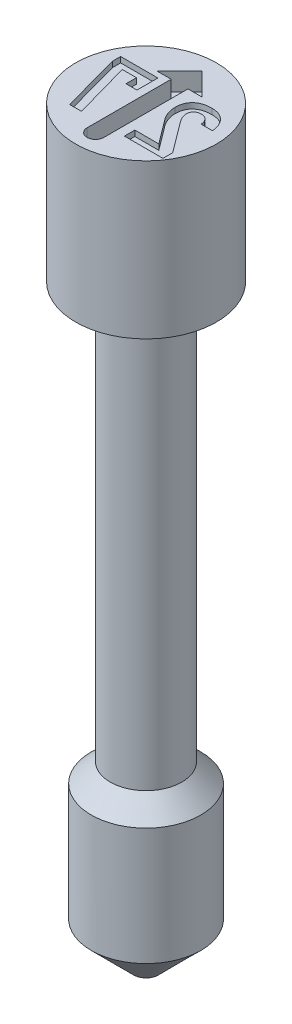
ISO-10303-21;
HEADER;
FILE_DESCRIPTION(('STEP AP214'),'2;1');
FILE_NAME('part.step','',(''),(''),'','','');
FILE_SCHEMA(('AUTOMOTIVE_DESIGN { 1 0 10303 214 1 1 1 1 }'));
ENDSEC;
DATA;
#1=APPLICATION_CONTEXT('core data for automotive mechanical design processes');
#2=APPLICATION_PROTOCOL_DEFINITION('international standard','automotive_design',2000,#1);
#3=PRODUCT_CONTEXT('',#1,'mechanical');
#4=PRODUCT('Part','Part','',(#3));
#5=PRODUCT_RELATED_PRODUCT_CATEGORY('part','',(#4));
#6=PRODUCT_DEFINITION_FORMATION('','',#4);
#7=PRODUCT_DEFINITION_CONTEXT('part definition',#1,'design');
#8=PRODUCT_DEFINITION('design','',#6,#7);
#9=PRODUCT_DEFINITION_SHAPE('','',#8);
#10=(LENGTH_UNIT() NAMED_UNIT(*) SI_UNIT(.MILLI.,.METRE.));
#11=(NAMED_UNIT(*) PLANE_ANGLE_UNIT() SI_UNIT($,.RADIAN.));
#12=(NAMED_UNIT(*) SI_UNIT($,.STERADIAN.) SOLID_ANGLE_UNIT());
#13=UNCERTAINTY_MEASURE_WITH_UNIT(LENGTH_MEASURE(1.E-05),#10,'distance_accuracy_value','');
#14=(GEOMETRIC_REPRESENTATION_CONTEXT(3) GLOBAL_UNCERTAINTY_ASSIGNED_CONTEXT((#13)) GLOBAL_UNIT_ASSIGNED_CONTEXT((#10,
#11,#12)) REPRESENTATION_CONTEXT('',''));
#15=CARTESIAN_POINT('',(0.,0.,0.));
#16=DIRECTION('',(0.,0.,1.));
#17=DIRECTION('',(1.,0.,0.));
#18=AXIS2_PLACEMENT_3D('',#15,#16,#17);
#19=CARTESIAN_POINT('',(0.,17.018,0.));
#20=DIRECTION('',(0.,1.,0.));
#21=DIRECTION('',(0.,0.,1.));
#22=AXIS2_PLACEMENT_3D('',#19,#20,#21);
#23=PLANE('',#22);
#24=DIRECTION('',(1.,0.,0.));
#25=VECTOR('',#24,1.);
#26=CARTESIAN_POINT('',(0.396715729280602,17.018,0.889));
#27=LINE('',#26,#25);
#28=CARTESIAN_POINT('',(0.396715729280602,17.018,0.889));
#29=VERTEX_POINT('',#28);
#30=CARTESIAN_POINT('',(1.27344868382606,17.018,0.889));
#31=VERTEX_POINT('',#30);
#32=EDGE_CURVE('E51',#29,#31,#27,.T.);
#33=ORIENTED_EDGE('',*,*,#32,.F.);
#34=DIRECTION('',(0.,0.,1.));
#35=VECTOR('',#34,1.);
#36=CARTESIAN_POINT('',(0.396715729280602,17.018,0.651493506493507));
#37=LINE('',#36,#35);
#38=CARTESIAN_POINT('',(0.396715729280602,17.018,0.651493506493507));
#39=VERTEX_POINT('',#38);
#40=EDGE_CURVE('E272',#39,#29,#37,.T.);
#41=ORIENTED_EDGE('',*,*,#40,.F.);
#42=DIRECTION('',(-1.,0.,0.));
#43=VECTOR('',#42,1.);
#44=CARTESIAN_POINT('',(0.942547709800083,17.018,0.651493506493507));
#45=LINE('',#44,#43);
#46=CARTESIAN_POINT('',(0.942547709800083,17.018,0.651493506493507));
#47=VERTEX_POINT('',#46);
#48=EDGE_CURVE('E275',#47,#39,#45,.T.);
#49=ORIENTED_EDGE('',*,*,#48,.F.);
#50=DIRECTION('',(0.601464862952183,0.,0.798899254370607));
#51=VECTOR('',#50,1.);
#52=CARTESIAN_POINT('',(0.53649819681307,17.018,0.112155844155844));
#53=LINE('',#52,#51);
#54=CARTESIAN_POINT('',(0.53649819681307,17.018,0.112155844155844));
#55=VERTEX_POINT('',#54);
#56=EDGE_CURVE('E587',#55,#47,#53,.T.);
#57=ORIENTED_EDGE('',*,*,#56,.F.);
#58=CARTESIAN_POINT('',(0.40506556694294,17.018,-0.254618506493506));
#59=CARTESIAN_POINT('',(0.405471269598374,17.018,-0.239027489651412));
#60=CARTESIAN_POINT('',(0.406286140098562,17.018,-0.207712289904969));
#61=CARTESIAN_POINT('',(0.413333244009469,17.018,-0.160595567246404));
#62=CARTESIAN_POINT('',(0.423509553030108,17.018,-0.112989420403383));
#63=CARTESIAN_POINT('',(0.438977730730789,17.018,-0.0655806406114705));
#64=CARTESIAN_POINT('',(0.457607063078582,17.018,-0.0186388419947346));
#65=CARTESIAN_POINT('',(0.480321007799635,17.018,0.0267661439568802));
#66=CARTESIAN_POINT('',(0.506242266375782,17.018,0.0707688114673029));
#67=CARTESIAN_POINT('',(0.526365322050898,17.018,0.0982951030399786));
#68=CARTESIAN_POINT('',(0.53649819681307,17.018,0.112155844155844));
#69=B_SPLINE_CURVE_WITH_KNOTS('',3,(#58,#59,#60,#61,#62,#63,#64,#65,#66,#67,#68),.UNSPECIFIED.,
.F.,.F.,(4,1,1,1,1,1,1,1,4),(0.,0.117962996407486,0.236933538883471,0.360005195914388,
0.486119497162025,0.613931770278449,0.742012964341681,0.870091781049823,1.),.UNSPECIFIED.);
#70=CARTESIAN_POINT('',(0.40506556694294,17.018,-0.254618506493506));
#71=VERTEX_POINT('',#70);
#72=EDGE_CURVE('E590',#71,#55,#69,.T.);
#73=ORIENTED_EDGE('',*,*,#72,.F.);
#74=DIRECTION('',(0.,0.,1.));
#75=VECTOR('',#74,1.);
#76=CARTESIAN_POINT('',(0.40506556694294,17.018,-0.255546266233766));
#77=LINE('',#76,#75);
#78=CARTESIAN_POINT('',(0.40506556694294,17.018,-0.255546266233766));
#79=VERTEX_POINT('',#78);
#80=EDGE_CURVE('E595',#79,#71,#77,.T.);
#81=ORIENTED_EDGE('',*,*,#80,.F.);
#82=CARTESIAN_POINT('',(0.843277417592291,17.018,-0.654792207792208));
#83=CARTESIAN_POINT('',(0.826254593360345,17.018,-0.654544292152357));
#84=CARTESIAN_POINT('',(0.793163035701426,17.018,-0.654062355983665));
#85=CARTESIAN_POINT('',(0.745110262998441,17.018,-0.648934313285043));
#86=CARTESIAN_POINT('',(0.699975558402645,17.018,-0.641058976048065));
#87=CARTESIAN_POINT('',(0.657797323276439,17.018,-0.629685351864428));
#88=CARTESIAN_POINT('',(0.618659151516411,17.018,-0.614810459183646));
#89=CARTESIAN_POINT('',(0.582524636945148,17.018,-0.596748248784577));
#90=CARTESIAN_POINT('',(0.54915805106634,17.018,-0.575762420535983));
#91=CARTESIAN_POINT('',(0.519054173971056,17.018,-0.55114141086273));
#92=CARTESIAN_POINT('',(0.492170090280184,17.018,-0.523673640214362));
#93=CARTESIAN_POINT('',(0.468649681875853,17.018,-0.493460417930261));
#94=CARTESIAN_POINT('',(0.449235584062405,17.018,-0.460240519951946));
#95=CARTESIAN_POINT('',(0.432539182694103,17.018,-0.424683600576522));
#96=CARTESIAN_POINT('',(0.420453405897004,17.018,-0.386017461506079));
#97=CARTESIAN_POINT('',(0.411356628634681,17.018,-0.344966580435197));
#98=CARTESIAN_POINT('',(0.40615060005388,17.018,-0.30113955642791));
#99=CARTESIAN_POINT('',(0.405433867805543,17.018,-0.2710223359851));
#100=CARTESIAN_POINT('',(0.40506556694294,17.018,-0.255546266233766));
#101=B_SPLINE_CURVE_WITH_KNOTS('',3,(#82,#83,#84,#85,#86,#87,#88,#89,#90,#91,#92,#93,#94,#95,
#96,#97,#98,#99,#100),.UNSPECIFIED.,.F.,.F.,(4,1,1,1,1,1,1,1,1,1,1,1,1,1,1,1,4),(0.,
0.0757177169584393,0.147191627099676,0.214761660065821,0.279410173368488,0.341256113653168,
0.400743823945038,0.458895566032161,0.516277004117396,0.573364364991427,0.629605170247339,
0.686164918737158,0.744246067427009,0.804009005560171,0.865999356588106,0.931142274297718,1.),.UNSPECIFIED.);
#102=CARTESIAN_POINT('',(0.843277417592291,17.018,-0.654792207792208));
#103=VERTEX_POINT('',#102);
#104=EDGE_CURVE('E601',#103,#79,#101,.T.);
#105=ORIENTED_EDGE('',*,*,#104,.F.);
#106=CARTESIAN_POINT('',(1.29200387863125,17.018,-0.218435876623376));
#107=CARTESIAN_POINT('',(1.2900256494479,17.018,-0.235388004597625));
#108=CARTESIAN_POINT('',(1.28616451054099,17.018,-0.268475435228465));
#109=CARTESIAN_POINT('',(1.27566263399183,17.018,-0.316155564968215));
#110=CARTESIAN_POINT('',(1.26281303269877,17.018,-0.360994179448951));
#111=CARTESIAN_POINT('',(1.24671495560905,17.018,-0.402932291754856));
#112=CARTESIAN_POINT('',(1.22750418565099,17.018,-0.441909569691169));
#113=CARTESIAN_POINT('',(1.20560976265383,17.018,-0.478214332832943));
#114=CARTESIAN_POINT('',(1.17993884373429,17.018,-0.510974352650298));
#115=CARTESIAN_POINT('',(1.15192762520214,17.018,-0.541168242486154));
#116=CARTESIAN_POINT('',(1.12085782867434,17.018,-0.567705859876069));
#117=CARTESIAN_POINT('',(1.08763218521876,17.018,-0.591036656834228));
#118=CARTESIAN_POINT('',(1.05225761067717,17.018,-0.610955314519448));
#119=CARTESIAN_POINT('',(1.01461928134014,17.018,-0.627110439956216));
#120=CARTESIAN_POINT('',(0.974775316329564,17.018,-0.639408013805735));
#121=CARTESIAN_POINT('',(0.932884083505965,17.018,-0.64843092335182));
#122=CARTESIAN_POINT('',(0.888768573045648,17.018,-0.653693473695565));
#123=CARTESIAN_POINT('',(0.858650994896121,17.018,-0.654420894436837));
#124=CARTESIAN_POINT('',(0.843277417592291,17.018,-0.654792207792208));
#125=B_SPLINE_CURVE_WITH_KNOTS('',3,(#106,#107,#108,#109,#110,#111,#112,#113,#114,#115,#116,
#117,#118,#119,#120,#121,#122,#123,#124),.UNSPECIFIED.,.F.,.F.,(4,1,1,1,1,1,1,1,1,1,1,1,1,1,1,1,
4),(0.,0.0735286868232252,0.143514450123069,0.210169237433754,0.274454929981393,
0.336856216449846,0.397291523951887,0.456843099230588,0.515945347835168,0.574554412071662,
0.632618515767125,0.690713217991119,0.749236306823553,0.808827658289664,0.870185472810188,
0.933735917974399,1.),.UNSPECIFIED.);
#126=CARTESIAN_POINT('',(1.29200387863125,17.018,-0.218435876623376));
#127=VERTEX_POINT('',#126);
#128=EDGE_CURVE('E606',#127,#103,#125,.T.);
#129=ORIENTED_EDGE('',*,*,#128,.F.);
#130=DIRECTION('',(0.,0.,-1.));
#131=VECTOR('',#130,1.);
#132=CARTESIAN_POINT('',(1.29200387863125,17.018,-0.217508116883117));
#133=LINE('',#132,#131);
#134=CARTESIAN_POINT('',(1.29200387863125,17.018,-0.217508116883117));
#135=VERTEX_POINT('',#134);
#136=EDGE_CURVE('E614',#135,#127,#133,.T.);
#137=ORIENTED_EDGE('',*,*,#136,.F.);
#138=DIRECTION('',(1.,0.,0.));
#139=VECTOR('',#138,1.);
#140=CARTESIAN_POINT('',(1.03532368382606,17.018,-0.217508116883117));
#141=LINE('',#140,#139);
#142=CARTESIAN_POINT('',(1.03532368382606,17.018,-0.217508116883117));
#143=VERTEX_POINT('',#142);
#144=EDGE_CURVE('E620',#143,#135,#141,.T.);
#145=ORIENTED_EDGE('',*,*,#144,.F.);
#146=DIRECTION('',(0.,0.,1.));
#147=VECTOR('',#146,1.);
#148=CARTESIAN_POINT('',(1.03532368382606,17.018,-0.218435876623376));
#149=LINE('',#148,#147);
#150=CARTESIAN_POINT('',(1.03532368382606,17.018,-0.218435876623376));
#151=VERTEX_POINT('',#150);
#152=EDGE_CURVE('E623',#151,#143,#149,.T.);
#153=ORIENTED_EDGE('',*,*,#152,.F.);
#154=CARTESIAN_POINT('',(0.841112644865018,17.018,-0.417285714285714));
#155=CARTESIAN_POINT('',(0.853973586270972,17.018,-0.416806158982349));
#156=CARTESIAN_POINT('',(0.878876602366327,17.018,-0.415877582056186));
#157=CARTESIAN_POINT('',(0.914224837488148,17.018,-0.405385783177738));
#158=CARTESIAN_POINT('',(0.946271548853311,17.018,-0.38926573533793));
#159=CARTESIAN_POINT('',(0.973885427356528,17.018,-0.365972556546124));
#160=CARTESIAN_POINT('',(0.997094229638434,17.018,-0.336937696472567));
#161=CARTESIAN_POINT('',(1.01549232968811,17.018,-0.302387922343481));
#162=CARTESIAN_POINT('',(1.0283730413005,17.018,-0.262224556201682));
#163=CARTESIAN_POINT('',(1.03293790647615,17.018,-0.233466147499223));
#164=CARTESIAN_POINT('',(1.03532368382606,17.018,-0.218435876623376));
#165=B_SPLINE_CURVE_WITH_KNOTS('',3,(#154,#155,#156,#157,#158,#159,#160,#161,#162,#163,#164),
.UNSPECIFIED.,.F.,.F.,(4,1,1,1,1,1,1,1,4),(0.,0.124986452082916,0.242014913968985,
0.3561482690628,0.472436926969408,0.591058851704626,0.716468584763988,0.851815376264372,1.),.UNSPECIFIED.);
#166=CARTESIAN_POINT('',(0.841112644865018,17.018,-0.417285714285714));
#167=VERTEX_POINT('',#166);
#168=EDGE_CURVE('E626',#167,#151,#165,.T.);
#169=ORIENTED_EDGE('',*,*,#168,.F.);
#170=CARTESIAN_POINT('',(0.662673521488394,17.018,-0.255546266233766));
#171=CARTESIAN_POINT('',(0.663090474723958,17.018,-0.267776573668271));
#172=CARTESIAN_POINT('',(0.663887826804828,17.018,-0.29116495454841));
#173=CARTESIAN_POINT('',(0.673136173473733,17.018,-0.323903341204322));
#174=CARTESIAN_POINT('',(0.687836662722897,17.018,-0.352389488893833));
#175=CARTESIAN_POINT('',(0.708798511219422,17.018,-0.375960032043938));
#176=CARTESIAN_POINT('',(0.734878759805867,17.018,-0.39471716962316));
#177=CARTESIAN_POINT('',(0.766038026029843,17.018,-0.40825039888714));
#178=CARTESIAN_POINT('',(0.802108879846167,17.018,-0.415707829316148));
#179=CARTESIAN_POINT('',(0.827677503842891,17.018,-0.416742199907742));
#180=CARTESIAN_POINT('',(0.841112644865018,17.018,-0.417285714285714));
#181=B_SPLINE_CURVE_WITH_KNOTS('',3,(#170,#171,#172,#173,#174,#175,#176,#177,#178,#179,#180),
.UNSPECIFIED.,.F.,.F.,(4,1,1,1,1,1,1,1,4),(0.,0.133827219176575,0.255921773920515,
0.369738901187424,0.482715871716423,0.598532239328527,0.719553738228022,0.852638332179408,1.),.UNSPECIFIED.);
#182=CARTESIAN_POINT('',(0.662673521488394,17.018,-0.255546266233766));
#183=VERTEX_POINT('',#182);
#184=EDGE_CURVE('E631',#183,#167,#181,.T.);
#185=ORIENTED_EDGE('',*,*,#184,.F.);
#186=DIRECTION('',(0.,0.,-1.));
#187=VECTOR('',#186,1.);
#188=CARTESIAN_POINT('',(0.662673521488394,17.018,-0.253381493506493));
#189=LINE('',#188,#187);
#190=CARTESIAN_POINT('',(0.662673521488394,17.018,-0.253381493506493));
#191=VERTEX_POINT('',#190);
#192=EDGE_CURVE('E639',#191,#183,#189,.T.);
#193=ORIENTED_EDGE('',*,*,#192,.F.);
#194=CARTESIAN_POINT('',(0.748336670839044,17.018,-0.034739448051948));
#195=CARTESIAN_POINT('',(0.741838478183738,17.018,-0.0437367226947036));
#196=CARTESIAN_POINT('',(0.729024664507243,17.018,-0.0614784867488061));
#197=CARTESIAN_POINT('',(0.711877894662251,17.018,-0.0890630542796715));
#198=CARTESIAN_POINT('',(0.697433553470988,17.018,-0.117291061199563));
#199=CARTESIAN_POINT('',(0.684977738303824,17.018,-0.14564105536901));
#200=CARTESIAN_POINT('',(0.675221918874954,17.018,-0.17378390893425));
#201=CARTESIAN_POINT('',(0.667851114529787,17.018,-0.201124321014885));
#202=CARTESIAN_POINT('',(0.663785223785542,17.018,-0.227592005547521));
#203=CARTESIAN_POINT('',(0.663038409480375,17.018,-0.244916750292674));
#204=CARTESIAN_POINT('',(0.662673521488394,17.018,-0.253381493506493));
#205=B_SPLINE_CURVE_WITH_KNOTS('',3,(#194,#195,#196,#197,#198,#199,#200,#201,#202,#203,#204),
.UNSPECIFIED.,.F.,.F.,(4,1,1,1,1,1,1,1,4),(0.,0.139527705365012,0.275135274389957,
0.407888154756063,0.537917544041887,0.66417107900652,0.782063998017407,0.893518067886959,1.),.UNSPECIFIED.);
#206=CARTESIAN_POINT('',(0.748336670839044,17.018,-0.034739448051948));
#207=VERTEX_POINT('',#206);
#208=EDGE_CURVE('E645',#207,#191,#205,.T.);
#209=ORIENTED_EDGE('',*,*,#208,.F.);
#210=DIRECTION('',(-0.597969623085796,0.,-0.801518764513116));
#211=VECTOR('',#210,1.);
#212=CARTESIAN_POINT('',(1.27344868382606,17.018,0.669120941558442));
#213=LINE('',#212,#211);
#214=CARTESIAN_POINT('',(1.27344868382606,17.018,0.669120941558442));
#215=VERTEX_POINT('',#214);
#216=EDGE_CURVE('E650',#215,#207,#213,.T.);
#217=ORIENTED_EDGE('',*,*,#216,.F.);
#218=DIRECTION('',(0.,0.,-1.));
#219=VECTOR('',#218,1.);
#220=CARTESIAN_POINT('',(1.27344868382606,17.018,0.889));
#221=LINE('',#220,#219);
#222=EDGE_CURVE('E656',#31,#215,#221,.T.);
#223=ORIENTED_EDGE('',*,*,#222,.F.);
#224=EDGE_LOOP('',(#33,#41,#49,#57,#73,#81,#105,#129,#137,#145,#153,#169,#185,#193,#209,#217,#223));
#225=FACE_BOUND('',#224,.T.);
#226=DIRECTION('',(-1.,0.,0.));
#227=VECTOR('',#226,1.);
#228=CARTESIAN_POINT('',(-0.366187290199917,17.018,-0.635));
#229=LINE('',#228,#227);
#230=CARTESIAN_POINT('',(-0.366187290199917,17.018,-0.635));
#231=VERTEX_POINT('',#230);
#232=CARTESIAN_POINT('',(-1.21261342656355,17.018,-0.635));
#233=VERTEX_POINT('',#232);
#234=EDGE_CURVE('E59',#231,#233,#229,.T.);
#235=ORIENTED_EDGE('',*,*,#234,.F.);
#236=DIRECTION('',(0.,0.,-1.));
#237=VECTOR('',#236,1.);
#238=CARTESIAN_POINT('',(-0.366187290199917,17.018,-0.159987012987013));
#239=LINE('',#238,#237);
#240=CARTESIAN_POINT('',(-0.366187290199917,17.018,-0.159987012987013));
#241=VERTEX_POINT('',#240);
#242=EDGE_CURVE('E504',#241,#231,#239,.T.);
#243=ORIENTED_EDGE('',*,*,#242,.F.);
#244=DIRECTION('',(1.,0.,0.));
#245=VECTOR('',#244,1.);
#246=CARTESIAN_POINT('',(-0.615445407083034,17.018,-0.159987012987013));
#247=LINE('',#246,#245);
#248=CARTESIAN_POINT('',(-0.615445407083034,17.018,-0.159987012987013));
#249=VERTEX_POINT('',#248);
#250=EDGE_CURVE('E508',#249,#241,#247,.T.);
#251=ORIENTED_EDGE('',*,*,#250,.F.);
#252=DIRECTION('',(0.,0.,1.));
#253=VECTOR('',#252,1.);
#254=CARTESIAN_POINT('',(-0.615445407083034,17.018,-0.397493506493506));
#255=LINE('',#254,#253);
#256=CARTESIAN_POINT('',(-0.615445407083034,17.018,-0.397493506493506));
#257=VERTEX_POINT('',#256);
#258=EDGE_CURVE('E511',#257,#249,#255,.T.);
#259=ORIENTED_EDGE('',*,*,#258,.F.);
#260=DIRECTION('',(1.,0.,0.));
#261=VECTOR('',#260,1.);
#262=CARTESIAN_POINT('',(-0.93892430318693,17.018,-0.397493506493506));
#263=LINE('',#262,#261);
#264=CARTESIAN_POINT('',(-0.93892430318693,17.018,-0.397493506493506));
#265=VERTEX_POINT('',#264);
#266=EDGE_CURVE('E514',#265,#257,#263,.T.);
#267=ORIENTED_EDGE('',*,*,#266,.F.);
#268=DIRECTION('',(-0.270102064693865,0.,-0.962831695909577));
#269=VECTOR('',#268,1.);
#270=CARTESIAN_POINT('',(-0.578025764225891,17.018,0.889));
#271=LINE('',#270,#269);
#272=CARTESIAN_POINT('',(-0.578025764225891,17.018,0.889));
#273=VERTEX_POINT('',#272);
#274=EDGE_CURVE('E517',#273,#265,#271,.T.);
#275=ORIENTED_EDGE('',*,*,#274,.F.);
#276=DIRECTION('',(1.,0.,0.));
#277=VECTOR('',#276,1.);
#278=CARTESIAN_POINT('',(-0.846148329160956,17.018,0.889));
#279=LINE('',#278,#277);
#280=CARTESIAN_POINT('',(-0.846148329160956,17.018,0.889));
#281=VERTEX_POINT('',#280);
#282=EDGE_CURVE('E520',#281,#273,#279,.T.);
#283=ORIENTED_EDGE('',*,*,#282,.F.);
#284=DIRECTION('',(0.264647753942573,0.,0.964345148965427));
#285=VECTOR('',#284,1.);
#286=CARTESIAN_POINT('',(-1.21261342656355,17.018,-0.446355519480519));
#287=LINE('',#286,#285);
#288=CARTESIAN_POINT('',(-1.21261342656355,17.018,-0.446355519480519));
#289=VERTEX_POINT('',#288);
#290=EDGE_CURVE('E523',#289,#281,#287,.T.);
#291=ORIENTED_EDGE('',*,*,#290,.F.);
#292=DIRECTION('',(0.,0.,1.));
#293=VECTOR('',#292,1.);
#294=CARTESIAN_POINT('',(-1.21261342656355,17.018,-0.635));
#295=LINE('',#294,#293);
#296=EDGE_CURVE('E526',#233,#289,#295,.T.);
#297=ORIENTED_EDGE('',*,*,#296,.F.);
#298=EDGE_LOOP('',(#235,#243,#251,#259,#267,#275,#283,#291,#297));
#299=FACE_BOUND('',#298,.T.);
#300=CARTESIAN_POINT('',(0.,17.018,1.14915906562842));
#301=DIRECTION('',(0.,1.,0.));
#302=DIRECTION('',(0.,0.,1.));
#303=AXIS2_PLACEMENT_3D('',#300,#301,#302);
#304=CIRCLE('',#303,0.1905);
#305=CARTESIAN_POINT('',(-0.1905,17.018,1.14915906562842));
#306=VERTEX_POINT('',#305);
#307=CARTESIAN_POINT('',(0.1905,17.018,1.14915906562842));
#308=VERTEX_POINT('',#307);
#309=EDGE_CURVE('E463',#306,#308,#304,.T.);
#310=ORIENTED_EDGE('',*,*,#309,.F.);
#311=DIRECTION('',(0.,0.,1.));
#312=VECTOR('',#311,1.);
#313=CARTESIAN_POINT('',(-0.1905,17.018,1.14915906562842));
#314=LINE('',#313,#312);
#315=CARTESIAN_POINT('',(-0.1905,17.018,-0.762));
#316=VERTEX_POINT('',#315);
#317=EDGE_CURVE('E444',#316,#306,#314,.T.);
#318=ORIENTED_EDGE('',*,*,#317,.F.);
#319=DIRECTION('',(1.,0.,0.));
#320=VECTOR('',#319,1.);
#321=CARTESIAN_POINT('',(-0.1905,17.018,-0.762));
#322=LINE('',#321,#320);
#323=CARTESIAN_POINT('',(-0.508,17.018,-0.762));
#324=VERTEX_POINT('',#323);
#325=EDGE_CURVE('E448',#324,#316,#322,.T.);
#326=ORIENTED_EDGE('',*,*,#325,.F.);
#327=DIRECTION('',(-0.707106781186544,0.,0.707106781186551));
#328=VECTOR('',#327,1.);
#329=CARTESIAN_POINT('',(0.,17.018,-1.27000000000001));
#330=LINE('',#329,#328);
#331=CARTESIAN_POINT('',(0.,17.018,-1.27000000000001));
#332=VERTEX_POINT('',#331);
#333=EDGE_CURVE('E451',#332,#324,#330,.T.);
#334=ORIENTED_EDGE('',*,*,#333,.F.);
#335=DIRECTION('',(-0.707106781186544,0.,-0.707106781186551));
#336=VECTOR('',#335,1.);
#337=CARTESIAN_POINT('',(0.508,17.018,-0.762));
#338=LINE('',#337,#336);
#339=CARTESIAN_POINT('',(0.508,17.018,-0.762));
#340=VERTEX_POINT('',#339);
#341=EDGE_CURVE('E454',#340,#332,#338,.T.);
#342=ORIENTED_EDGE('',*,*,#341,.F.);
#343=DIRECTION('',(1.,0.,0.));
#344=VECTOR('',#343,1.);
#345=CARTESIAN_POINT('',(0.1905,17.018,-0.762));
#346=LINE('',#345,#344);
#347=CARTESIAN_POINT('',(0.1905,17.018,-0.762));
#348=VERTEX_POINT('',#347);
#349=EDGE_CURVE('E457',#348,#340,#346,.T.);
#350=ORIENTED_EDGE('',*,*,#349,.F.);
#351=DIRECTION('',(0.,0.,-1.));
#352=VECTOR('',#351,1.);
#353=CARTESIAN_POINT('',(0.1905,17.018,1.14915906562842));
#354=LINE('',#353,#352);
#355=EDGE_CURVE('E460',#308,#348,#354,.T.);
#356=ORIENTED_EDGE('',*,*,#355,.F.);
#357=EDGE_LOOP('',(#310,#318,#326,#334,#342,#350,#356));
#358=FACE_BOUND('',#357,.T.);
#359=CARTESIAN_POINT('',(0.,17.018,0.));
#360=DIRECTION('',(0.,-1.,0.));
#361=DIRECTION('',(0.,0.,-1.));
#362=AXIS2_PLACEMENT_3D('',#359,#360,#361);
#363=CIRCLE('',#362,1.6002);
#364=CARTESIAN_POINT('',(0.,17.018,-1.6002));
#365=VERTEX_POINT('',#364);
#366=EDGE_CURVE('E11',#365,#365,#363,.T.);
#367=ORIENTED_EDGE('',*,*,#366,.F.);
#368=EDGE_LOOP('',(#367));
#369=FACE_BOUND('',#368,.T.);
#370=ADVANCED_FACE('F37',(#225,#299,#358,#369),#23,.T.);
#371=CARTESIAN_POINT('',(0.,0.,0.));
#372=DIRECTION('',(0.,-1.,0.));
#373=DIRECTION('',(0.,0.,-1.));
#374=AXIS2_PLACEMENT_3D('',#371,#372,#373);
#375=CYLINDRICAL_SURFACE('',#374,1.6002);
#376=ORIENTED_EDGE('',*,*,#366,.T.);
#377=EDGE_LOOP('',(#376));
#378=FACE_BOUND('',#377,.T.);
#379=CARTESIAN_POINT('',(0.,13.5128,0.));
#380=DIRECTION('',(0.,-1.,0.));
#381=DIRECTION('',(0.,0.,-1.));
#382=AXIS2_PLACEMENT_3D('',#379,#380,#381);
#383=CIRCLE('',#382,1.6002);
#384=CARTESIAN_POINT('',(0.,13.5128,-1.6002));
#385=VERTEX_POINT('',#384);
#386=EDGE_CURVE('E44',#385,#385,#383,.T.);
#387=ORIENTED_EDGE('',*,*,#386,.F.);
#388=EDGE_LOOP('',(#387));
#389=FACE_BOUND('',#388,.T.);
#390=ADVANCED_FACE('F400',(#378,#389),#375,.T.);
#391=CARTESIAN_POINT('',(1.6002,13.5128,0.));
#392=DIRECTION('',(0.,-1.,0.));
#393=DIRECTION('',(0.,0.,-1.));
#394=AXIS2_PLACEMENT_3D('',#391,#392,#393);
#395=PLANE('',#394);
#396=ORIENTED_EDGE('',*,*,#386,.T.);
#397=EDGE_LOOP('',(#396));
#398=FACE_BOUND('',#397,.T.);
#399=CARTESIAN_POINT('',(0.,13.5128,0.));
#400=DIRECTION('',(0.,-1.,0.));
#401=DIRECTION('',(0.,0.,-1.));
#402=AXIS2_PLACEMENT_3D('',#399,#400,#401);
#403=CIRCLE('',#402,0.812799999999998);
#404=CARTESIAN_POINT('',(0.,13.5128,-0.812799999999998));
#405=VERTEX_POINT('',#404);
#406=EDGE_CURVE('E412',#405,#405,#403,.T.);
#407=ORIENTED_EDGE('',*,*,#406,.F.);
#408=EDGE_LOOP('',(#407));
#409=FACE_BOUND('',#408,.T.);
#410=ADVANCED_FACE('F397',(#398,#409),#395,.T.);
#411=CARTESIAN_POINT('',(0.,0.,0.));
#412=DIRECTION('',(0.,-1.,0.));
#413=DIRECTION('',(0.,0.,-1.));
#414=AXIS2_PLACEMENT_3D('',#411,#412,#413);
#415=CYLINDRICAL_SURFACE('',#414,0.812799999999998);
#416=ORIENTED_EDGE('',*,*,#406,.T.);
#417=EDGE_LOOP('',(#416));
#418=FACE_BOUND('',#417,.T.);
#419=CARTESIAN_POINT('',(0.,4.064,0.));
#420=DIRECTION('',(0.,-1.,0.));
#421=DIRECTION('',(0.,0.,-1.));
#422=AXIS2_PLACEMENT_3D('',#419,#420,#421);
#423=CIRCLE('',#422,0.812799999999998);
#424=CARTESIAN_POINT('',(0.,4.064,-0.812799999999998));
#425=VERTEX_POINT('',#424);
#426=EDGE_CURVE('E414',#425,#425,#423,.T.);
#427=ORIENTED_EDGE('',*,*,#426,.F.);
#428=EDGE_LOOP('',(#427));
#429=FACE_BOUND('',#428,.T.);
#430=ADVANCED_FACE('F393',(#418,#429),#415,.T.);
#431=CARTESIAN_POINT('',(0.,3.63220000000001,0.));
#432=DIRECTION('',(0.,-1.,0.));
#433=DIRECTION('',(0.,0.,-1.));
#434=AXIS2_PLACEMENT_3D('',#431,#432,#433);
#435=CONICAL_SURFACE('',#434,1.2446,0.785398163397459);
#436=ORIENTED_EDGE('',*,*,#426,.T.);
#437=EDGE_LOOP('',(#436));
#438=FACE_BOUND('',#437,.T.);
#439=CARTESIAN_POINT('',(0.,3.63220000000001,0.));
#440=DIRECTION('',(0.,-1.,0.));
#441=DIRECTION('',(0.,0.,-1.));
#442=AXIS2_PLACEMENT_3D('',#439,#440,#441);
#443=CIRCLE('',#442,1.2446);
#444=CARTESIAN_POINT('',(0.,3.63220000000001,-1.2446));
#445=VERTEX_POINT('',#444);
#446=EDGE_CURVE('E419',#445,#445,#443,.T.);
#447=ORIENTED_EDGE('',*,*,#446,.F.);
#448=EDGE_LOOP('',(#447));
#449=FACE_BOUND('',#448,.T.);
#450=ADVANCED_FACE('F389',(#438,#449),#435,.T.);
#451=CARTESIAN_POINT('',(0.,0.,0.));
#452=DIRECTION('',(0.,-1.,0.));
#453=DIRECTION('',(0.,0.,-1.));
#454=AXIS2_PLACEMENT_3D('',#451,#452,#453);
#455=CYLINDRICAL_SURFACE('',#454,1.2446);
#456=ORIENTED_EDGE('',*,*,#446,.T.);
#457=EDGE_LOOP('',(#456));
#458=FACE_BOUND('',#457,.T.);
#459=CARTESIAN_POINT('',(0.,0.9652,0.));
#460=DIRECTION('',(0.,-1.,0.));
#461=DIRECTION('',(0.,0.,-1.));
#462=AXIS2_PLACEMENT_3D('',#459,#460,#461);
#463=CIRCLE('',#462,1.2446);
#464=CARTESIAN_POINT('',(0.,0.9652,1.2446));
#465=VERTEX_POINT('',#464);
#466=EDGE_CURVE('E422',#465,#465,#463,.T.);
#467=ORIENTED_EDGE('',*,*,#466,.F.);
#468=EDGE_LOOP('',(#467));
#469=FACE_BOUND('',#468,.T.);
#470=ADVANCED_FACE('F385',(#458,#469),#455,.T.);
#471=CARTESIAN_POINT('',(0.,0.,0.));
#472=DIRECTION('',(0.,1.,0.));
#473=DIRECTION('',(0.,0.,1.));
#474=AXIS2_PLACEMENT_3D('',#471,#472,#473);
#475=CONICAL_SURFACE('',#474,0.279400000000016,0.78539816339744);
#476=CARTESIAN_POINT('',(0.,0.,0.));
#477=DIRECTION('',(0.,-1.,0.));
#478=DIRECTION('',(0.,0.,-1.));
#479=AXIS2_PLACEMENT_3D('',#476,#477,#478);
#480=CIRCLE('',#479,0.279400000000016);
#481=CARTESIAN_POINT('',(0.,0.,0.279400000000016));
#482=VERTEX_POINT('',#481);
#483=EDGE_CURVE('E425',#482,#482,#480,.T.);
#484=CARTESIAN_POINT('',(0.,0.9652,1.2446));
#485=CARTESIAN_POINT('',(0.,0.955145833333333,1.23454583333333));
#486=CARTESIAN_POINT('',(0.,0.945091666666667,1.22449166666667));
#487=CARTESIAN_POINT('',(0.,0.924983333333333,1.20438333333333));
#488=CARTESIAN_POINT('',(0.,0.914929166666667,1.19432916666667));
#489=CARTESIAN_POINT('',(0.,0.894820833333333,1.17422083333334));
#490=CARTESIAN_POINT('',(0.,0.884766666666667,1.16416666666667));
#491=CARTESIAN_POINT('',(0.,0.864658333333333,1.14405833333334));
#492=CARTESIAN_POINT('',(0.,0.854604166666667,1.13400416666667));
#493=CARTESIAN_POINT('',(0.,0.834495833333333,1.11389583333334));
#494=CARTESIAN_POINT('',(0.,0.824441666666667,1.10384166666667));
#495=CARTESIAN_POINT('',(0.,0.804333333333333,1.08373333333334));
#496=CARTESIAN_POINT('',(0.,0.794279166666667,1.07367916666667));
#497=CARTESIAN_POINT('',(0.,0.774170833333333,1.05357083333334));
#498=CARTESIAN_POINT('',(0.,0.764116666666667,1.04351666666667));
#499=CARTESIAN_POINT('',(0.,0.744008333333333,1.02340833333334));
#500=CARTESIAN_POINT('',(0.,0.733954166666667,1.01335416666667));
#501=CARTESIAN_POINT('',(0.,0.713845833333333,0.993245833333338));
#502=CARTESIAN_POINT('',(0.,0.703791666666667,0.983191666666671));
#503=CARTESIAN_POINT('',(0.,0.683683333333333,0.963083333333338));
#504=CARTESIAN_POINT('',(0.,0.673629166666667,0.953029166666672));
#505=CARTESIAN_POINT('',(0.,0.653520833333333,0.932920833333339));
#506=CARTESIAN_POINT('',(0.,0.643466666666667,0.922866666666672));
#507=CARTESIAN_POINT('',(0.,0.623358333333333,0.902758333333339));
#508=CARTESIAN_POINT('',(0.,0.613304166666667,0.892704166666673));
#509=CARTESIAN_POINT('',(0.,0.593195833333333,0.87259583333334));
#510=CARTESIAN_POINT('',(0.,0.583141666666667,0.862541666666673));
#511=CARTESIAN_POINT('',(0.,0.563033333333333,0.84243333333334));
#512=CARTESIAN_POINT('',(0.,0.552979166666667,0.832379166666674));
#513=CARTESIAN_POINT('',(0.,0.532870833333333,0.812270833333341));
#514=CARTESIAN_POINT('',(0.,0.522816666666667,0.802216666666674));
#515=CARTESIAN_POINT('',(0.,0.502708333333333,0.782108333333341));
#516=CARTESIAN_POINT('',(0.,0.492654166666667,0.772054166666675));
#517=CARTESIAN_POINT('',(0.,0.472545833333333,0.751945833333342));
#518=CARTESIAN_POINT('',(0.,0.462491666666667,0.741891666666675));
#519=CARTESIAN_POINT('',(0.,0.442383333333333,0.721783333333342));
#520=CARTESIAN_POINT('',(0.,0.432329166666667,0.711729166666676));
#521=CARTESIAN_POINT('',(0.,0.412220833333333,0.691620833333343));
#522=CARTESIAN_POINT('',(0.,0.402166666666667,0.681566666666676));
#523=CARTESIAN_POINT('',(0.,0.382058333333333,0.661458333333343));
#524=CARTESIAN_POINT('',(0.,0.372004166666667,0.651404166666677));
#525=CARTESIAN_POINT('',(0.,0.351895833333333,0.631295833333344));
#526=CARTESIAN_POINT('',(0.,0.341841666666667,0.621241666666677));
#527=CARTESIAN_POINT('',(0.,0.321733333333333,0.601133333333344));
#528=CARTESIAN_POINT('',(0.,0.311679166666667,0.591079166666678));
#529=CARTESIAN_POINT('',(0.,0.291570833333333,0.570970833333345));
#530=CARTESIAN_POINT('',(0.,0.281516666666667,0.560916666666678));
#531=CARTESIAN_POINT('',(0.,0.261408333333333,0.540808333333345));
#532=CARTESIAN_POINT('',(0.,0.251354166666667,0.530754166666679));
#533=CARTESIAN_POINT('',(0.,0.231245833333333,0.510645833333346));
#534=CARTESIAN_POINT('',(0.,0.221191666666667,0.500591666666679));
#535=CARTESIAN_POINT('',(0.,0.201083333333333,0.480483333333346));
#536=CARTESIAN_POINT('',(0.,0.191029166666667,0.47042916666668));
#537=CARTESIAN_POINT('',(0.,0.170920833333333,0.450320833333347));
#538=CARTESIAN_POINT('',(0.,0.160866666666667,0.44026666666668));
#539=CARTESIAN_POINT('',(0.,0.140758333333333,0.420158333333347));
#540=CARTESIAN_POINT('',(0.,0.130704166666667,0.410104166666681));
#541=CARTESIAN_POINT('',(0.,0.110595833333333,0.389995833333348));
#542=CARTESIAN_POINT('',(0.,0.100541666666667,0.379941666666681));
#543=CARTESIAN_POINT('',(0.,0.0804333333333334,0.359833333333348));
#544=CARTESIAN_POINT('',(0.,0.0703791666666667,0.349779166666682));
#545=CARTESIAN_POINT('',(0.,0.0502708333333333,0.329670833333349));
#546=CARTESIAN_POINT('',(0.,0.0402166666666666,0.319616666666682));
#547=CARTESIAN_POINT('',(0.,0.0201083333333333,0.299508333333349));
#548=CARTESIAN_POINT('',(0.,0.0100541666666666,0.289454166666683));
#549=CARTESIAN_POINT('',(0.,0.,0.279400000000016));
#550=B_SPLINE_CURVE_WITH_KNOTS('',3,(#484,#485,#486,#487,#488,#489,#490,#491,#492,#493,#494,
#495,#496,#497,#498,#499,#500,#501,#502,#503,#504,#505,#506,#507,#508,#509,#510,#511,#512,#513,
#514,#515,#516,#517,#518,#519,#520,#521,#522,#523,#524,#525,#526,#527,#528,#529,#530,#531,#532,
#533,#534,#535,#536,#537,#538,#539,#540,#541,#542,#543,#544,#545,#546,#547,#548,#549),
.UNSPECIFIED.,.F.,.F.,(4,2,2,2,2,2,2,2,2,2,2,2,2,2,2,2,2,2,2,2,2,2,2,2,2,2,2,2,2,2,2,2,4),(0.,
0.0426562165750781,0.0853124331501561,0.127968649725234,0.170624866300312,0.21328108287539,
0.255937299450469,0.298593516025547,0.341249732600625,0.383905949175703,0.426562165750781,
0.469218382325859,0.511874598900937,0.554530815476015,0.597187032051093,0.639843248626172,
0.68249946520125,0.725155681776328,0.767811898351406,0.810468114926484,0.853124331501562,
0.895780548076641,0.938436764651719,0.981092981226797,1.02374919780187,1.06640541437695,
1.10906163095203,1.15171784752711,1.19437406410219,1.23703028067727,1.27968649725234,
1.32234271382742,1.3649989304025),.UNSPECIFIED.);
#551=EDGE_CURVE('BSEAM381',#465,#482,#550,.T.);
#552=ORIENTED_EDGE('',*,*,#466,.T.);
#553=ORIENTED_EDGE('',*,*,#483,.F.);
#554=ORIENTED_EDGE('',*,*,#551,.T.);
#555=ORIENTED_EDGE('',*,*,#551,.F.);
#556=EDGE_LOOP('',(#552,#554,#553,#555));
#557=FACE_BOUND('',#556,.T.);
#558=ADVANCED_FACE('F381',(#557),#475,.T.);
#559=CARTESIAN_POINT('',(0.279400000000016,0.,0.));
#560=DIRECTION('',(0.,-1.,0.));
#561=DIRECTION('',(0.,0.,-1.));
#562=AXIS2_PLACEMENT_3D('',#559,#560,#561);
#563=PLANE('',#562);
#564=ORIENTED_EDGE('',*,*,#483,.T.);
#565=EDGE_LOOP('',(#564));
#566=FACE_BOUND('',#565,.T.);
#567=ADVANCED_FACE('F377',(#566),#563,.T.);
#568=CARTESIAN_POINT('',(0.,16.6116,1.14915906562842));
#569=DIRECTION('',(0.,1.,0.));
#570=DIRECTION('',(0.,0.,1.));
#571=AXIS2_PLACEMENT_3D('',#568,#569,#570);
#572=CYLINDRICAL_SURFACE('',#571,0.1905);
#573=ORIENTED_EDGE('',*,*,#309,.T.);
#574=DIRECTION('',(0.,1.,0.));
#575=VECTOR('',#574,1.);
#576=CARTESIAN_POINT('',(0.1905,16.6116,1.14915906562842));
#577=LINE('',#576,#575);
#578=CARTESIAN_POINT('',(0.1905,16.6116,1.14915906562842));
#579=VERTEX_POINT('',#578);
#580=EDGE_CURVE('E429',#579,#308,#577,.T.);
#581=ORIENTED_EDGE('',*,*,#580,.F.);
#582=CARTESIAN_POINT('',(0.,16.6116,1.14915906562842));
#583=DIRECTION('',(0.,1.,0.));
#584=DIRECTION('',(0.,0.,1.));
#585=AXIS2_PLACEMENT_3D('',#582,#583,#584);
#586=CIRCLE('',#585,0.1905);
#587=CARTESIAN_POINT('',(-0.1905,16.6116,1.14915906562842));
#588=VERTEX_POINT('',#587);
#589=EDGE_CURVE('E447',#588,#579,#586,.T.);
#590=ORIENTED_EDGE('',*,*,#589,.F.);
#591=DIRECTION('',(0.,1.,0.));
#592=VECTOR('',#591,1.);
#593=CARTESIAN_POINT('',(-0.1905,16.6116,1.14915906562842));
#594=LINE('',#593,#592);
#595=EDGE_CURVE('E428',#588,#306,#594,.T.);
#596=ORIENTED_EDGE('',*,*,#595,.T.);
#597=EDGE_LOOP('',(#573,#581,#590,#596));
#598=FACE_BOUND('',#597,.T.);
#599=ADVANCED_FACE('F355',(#598),#572,.F.);
#600=CARTESIAN_POINT('',(-0.1905,16.6116,1.14915906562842));
#601=DIRECTION('',(-1.,0.,0.));
#602=DIRECTION('',(0.,0.,1.));
#603=AXIS2_PLACEMENT_3D('',#600,#601,#602);
#604=PLANE('',#603);
#605=ORIENTED_EDGE('',*,*,#317,.T.);
#606=ORIENTED_EDGE('',*,*,#595,.F.);
#607=DIRECTION('',(0.,0.,1.));
#608=VECTOR('',#607,1.);
#609=CARTESIAN_POINT('',(-0.1905,16.6116,1.14915906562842));
#610=LINE('',#609,#608);
#611=CARTESIAN_POINT('',(-0.1905,16.6116,-0.762));
#612=VERTEX_POINT('',#611);
#613=EDGE_CURVE('E433',#612,#588,#610,.T.);
#614=ORIENTED_EDGE('',*,*,#613,.F.);
#615=DIRECTION('',(0.,1.,0.));
#616=VECTOR('',#615,1.);
#617=CARTESIAN_POINT('',(-0.1905,16.6116,-0.762));
#618=LINE('',#617,#616);
#619=EDGE_CURVE('E441',#612,#316,#618,.T.);
#620=ORIENTED_EDGE('',*,*,#619,.T.);
#621=EDGE_LOOP('',(#605,#606,#614,#620));
#622=FACE_BOUND('',#621,.T.);
#623=ADVANCED_FACE('F351',(#622),#604,.F.);
#624=CARTESIAN_POINT('',(-0.1905,16.6116,-0.762));
#625=DIRECTION('',(0.,0.,1.));
#626=DIRECTION('',(1.,0.,0.));
#627=AXIS2_PLACEMENT_3D('',#624,#625,#626);
#628=PLANE('',#627);
#629=ORIENTED_EDGE('',*,*,#325,.T.);
#630=ORIENTED_EDGE('',*,*,#619,.F.);
#631=DIRECTION('',(1.,0.,0.));
#632=VECTOR('',#631,1.);
#633=CARTESIAN_POINT('',(-0.1905,16.6116,-0.762));
#634=LINE('',#633,#632);
#635=CARTESIAN_POINT('',(-0.508,16.6116,-0.762));
#636=VERTEX_POINT('',#635);
#637=EDGE_CURVE('E468',#636,#612,#634,.T.);
#638=ORIENTED_EDGE('',*,*,#637,.F.);
#639=DIRECTION('',(0.,1.,0.));
#640=VECTOR('',#639,1.);
#641=CARTESIAN_POINT('',(-0.508,16.6116,-0.762));
#642=LINE('',#641,#640);
#643=EDGE_CURVE('E439',#636,#324,#642,.T.);
#644=ORIENTED_EDGE('',*,*,#643,.T.);
#645=EDGE_LOOP('',(#629,#630,#638,#644));
#646=FACE_BOUND('',#645,.T.);
#647=ADVANCED_FACE('F354',(#646),#628,.F.);
#648=CARTESIAN_POINT('',(0.,16.6116,-1.27000000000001));
#649=DIRECTION('',(-0.707106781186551,0.,-0.707106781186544));
#650=DIRECTION('',(-0.707106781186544,0.,0.707106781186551));
#651=AXIS2_PLACEMENT_3D('',#648,#649,#650);
#652=PLANE('',#651);
#653=ORIENTED_EDGE('',*,*,#333,.T.);
#654=ORIENTED_EDGE('',*,*,#643,.F.);
#655=DIRECTION('',(-0.707106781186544,0.,0.707106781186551));
#656=VECTOR('',#655,1.);
#657=CARTESIAN_POINT('',(0.,16.6116,-1.27000000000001));
#658=LINE('',#657,#656);
#659=CARTESIAN_POINT('',(0.,16.6116,-1.27000000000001));
#660=VERTEX_POINT('',#659);
#661=EDGE_CURVE('E471',#660,#636,#658,.T.);
#662=ORIENTED_EDGE('',*,*,#661,.F.);
#663=DIRECTION('',(0.,1.,0.));
#664=VECTOR('',#663,1.);
#665=CARTESIAN_POINT('',(0.,16.6116,-1.27000000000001));
#666=LINE('',#665,#664);
#667=EDGE_CURVE('E437',#660,#332,#666,.T.);
#668=ORIENTED_EDGE('',*,*,#667,.T.);
#669=EDGE_LOOP('',(#653,#654,#662,#668));
#670=FACE_BOUND('',#669,.T.);
#671=ADVANCED_FACE('F359',(#670),#652,.F.);
#672=CARTESIAN_POINT('',(0.508,16.6116,-0.762));
#673=DIRECTION('',(0.707106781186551,0.,-0.707106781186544));
#674=DIRECTION('',(-0.707106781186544,0.,-0.707106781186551));
#675=AXIS2_PLACEMENT_3D('',#672,#673,#674);
#676=PLANE('',#675);
#677=ORIENTED_EDGE('',*,*,#341,.T.);
#678=ORIENTED_EDGE('',*,*,#667,.F.);
#679=DIRECTION('',(-0.707106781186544,0.,-0.707106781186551));
#680=VECTOR('',#679,1.);
#681=CARTESIAN_POINT('',(0.508,16.6116,-0.762));
#682=LINE('',#681,#680);
#683=CARTESIAN_POINT('',(0.508,16.6116,-0.762));
#684=VERTEX_POINT('',#683);
#685=EDGE_CURVE('E474',#684,#660,#682,.T.);
#686=ORIENTED_EDGE('',*,*,#685,.F.);
#687=DIRECTION('',(0.,1.,0.));
#688=VECTOR('',#687,1.);
#689=CARTESIAN_POINT('',(0.508,16.6116,-0.762));
#690=LINE('',#689,#688);
#691=EDGE_CURVE('E435',#684,#340,#690,.T.);
#692=ORIENTED_EDGE('',*,*,#691,.T.);
#693=EDGE_LOOP('',(#677,#678,#686,#692));
#694=FACE_BOUND('',#693,.T.);
#695=ADVANCED_FACE('F363',(#694),#676,.F.);
#696=CARTESIAN_POINT('',(0.1905,16.6116,-0.762));
#697=DIRECTION('',(0.,0.,1.));
#698=DIRECTION('',(1.,0.,0.));
#699=AXIS2_PLACEMENT_3D('',#696,#697,#698);
#700=PLANE('',#699);
#701=ORIENTED_EDGE('',*,*,#349,.T.);
#702=ORIENTED_EDGE('',*,*,#691,.F.);
#703=DIRECTION('',(1.,0.,0.));
#704=VECTOR('',#703,1.);
#705=CARTESIAN_POINT('',(0.1905,16.6116,-0.762));
#706=LINE('',#705,#704);
#707=CARTESIAN_POINT('',(0.1905,16.6116,-0.762));
#708=VERTEX_POINT('',#707);
#709=EDGE_CURVE('E477',#708,#684,#706,.T.);
#710=ORIENTED_EDGE('',*,*,#709,.F.);
#711=DIRECTION('',(0.,1.,0.));
#712=VECTOR('',#711,1.);
#713=CARTESIAN_POINT('',(0.1905,16.6116,-0.762));
#714=LINE('',#713,#712);
#715=EDGE_CURVE('E432',#708,#348,#714,.T.);
#716=ORIENTED_EDGE('',*,*,#715,.T.);
#717=EDGE_LOOP('',(#701,#702,#710,#716));
#718=FACE_BOUND('',#717,.T.);
#719=ADVANCED_FACE('F367',(#718),#700,.F.);
#720=CARTESIAN_POINT('',(0.1905,16.6116,1.14915906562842));
#721=DIRECTION('',(1.,0.,0.));
#722=DIRECTION('',(0.,0.,-1.));
#723=AXIS2_PLACEMENT_3D('',#720,#721,#722);
#724=PLANE('',#723);
#725=ORIENTED_EDGE('',*,*,#355,.T.);
#726=ORIENTED_EDGE('',*,*,#715,.F.);
#727=DIRECTION('',(0.,0.,-1.));
#728=VECTOR('',#727,1.);
#729=CARTESIAN_POINT('',(0.1905,16.6116,1.14915906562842));
#730=LINE('',#729,#728);
#731=EDGE_CURVE('E480',#579,#708,#730,.T.);
#732=ORIENTED_EDGE('',*,*,#731,.F.);
#733=ORIENTED_EDGE('',*,*,#580,.T.);
#734=EDGE_LOOP('',(#725,#726,#732,#733));
#735=FACE_BOUND('',#734,.T.);
#736=ADVANCED_FACE('F349',(#735),#724,.F.);
#737=CARTESIAN_POINT('',(0.,16.6116,1.14915906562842));
#738=DIRECTION('',(0.,1.,0.));
#739=DIRECTION('',(0.,0.,1.));
#740=AXIS2_PLACEMENT_3D('',#737,#738,#739);
#741=PLANE('',#740);
#742=ORIENTED_EDGE('',*,*,#589,.T.);
#743=ORIENTED_EDGE('',*,*,#731,.T.);
#744=ORIENTED_EDGE('',*,*,#709,.T.);
#745=ORIENTED_EDGE('',*,*,#685,.T.);
#746=ORIENTED_EDGE('',*,*,#661,.T.);
#747=ORIENTED_EDGE('',*,*,#637,.T.);
#748=ORIENTED_EDGE('',*,*,#613,.T.);
#749=EDGE_LOOP('',(#742,#743,#744,#745,#746,#747,#748));
#750=FACE_BOUND('',#749,.T.);
#751=ADVANCED_FACE('F346',(#750),#741,.T.);
#752=CARTESIAN_POINT('',(-0.366187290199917,16.891,-0.635));
#753=DIRECTION('',(0.,0.,-1.));
#754=DIRECTION('',(-1.,0.,0.));
#755=AXIS2_PLACEMENT_3D('',#752,#753,#754);
#756=PLANE('',#755);
#757=ORIENTED_EDGE('',*,*,#234,.T.);
#758=DIRECTION('',(0.,1.,0.));
#759=VECTOR('',#758,1.);
#760=CARTESIAN_POINT('',(-1.21261342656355,16.891,-0.635));
#761=LINE('',#760,#759);
#762=CARTESIAN_POINT('',(-1.21261342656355,16.891,-0.635));
#763=VERTEX_POINT('',#762);
#764=EDGE_CURVE('E485',#763,#233,#761,.T.);
#765=ORIENTED_EDGE('',*,*,#764,.F.);
#766=DIRECTION('',(-1.,0.,0.));
#767=VECTOR('',#766,1.);
#768=CARTESIAN_POINT('',(-0.366187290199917,16.891,-0.635));
#769=LINE('',#768,#767);
#770=CARTESIAN_POINT('',(-0.366187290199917,16.891,-0.635));
#771=VERTEX_POINT('',#770);
#772=EDGE_CURVE('E507',#771,#763,#769,.T.);
#773=ORIENTED_EDGE('',*,*,#772,.F.);
#774=DIRECTION('',(0.,1.,0.));
#775=VECTOR('',#774,1.);
#776=CARTESIAN_POINT('',(-0.366187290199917,16.891,-0.635));
#777=LINE('',#776,#775);
#778=EDGE_CURVE('E502',#771,#231,#777,.T.);
#779=ORIENTED_EDGE('',*,*,#778,.T.);
#780=EDGE_LOOP('',(#757,#765,#773,#779));
#781=FACE_BOUND('',#780,.T.);
#782=ADVANCED_FACE('F316',(#781),#756,.F.);
#783=CARTESIAN_POINT('',(-0.366187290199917,16.891,-0.159987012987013));
#784=DIRECTION('',(1.,0.,0.));
#785=DIRECTION('',(0.,0.,-1.));
#786=AXIS2_PLACEMENT_3D('',#783,#784,#785);
#787=PLANE('',#786);
#788=ORIENTED_EDGE('',*,*,#242,.T.);
#789=ORIENTED_EDGE('',*,*,#778,.F.);
#790=DIRECTION('',(0.,0.,-1.));
#791=VECTOR('',#790,1.);
#792=CARTESIAN_POINT('',(-0.366187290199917,16.891,-0.159987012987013));
#793=LINE('',#792,#791);
#794=CARTESIAN_POINT('',(-0.366187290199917,16.891,-0.159987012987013));
#795=VERTEX_POINT('',#794);
#796=EDGE_CURVE('E488',#795,#771,#793,.T.);
#797=ORIENTED_EDGE('',*,*,#796,.F.);
#798=DIRECTION('',(0.,1.,0.));
#799=VECTOR('',#798,1.);
#800=CARTESIAN_POINT('',(-0.366187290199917,16.891,-0.159987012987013));
#801=LINE('',#800,#799);
#802=EDGE_CURVE('E500',#795,#241,#801,.T.);
#803=ORIENTED_EDGE('',*,*,#802,.T.);
#804=EDGE_LOOP('',(#788,#789,#797,#803));
#805=FACE_BOUND('',#804,.T.);
#806=ADVANCED_FACE('F312',(#805),#787,.F.);
#807=CARTESIAN_POINT('',(-0.615445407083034,16.891,-0.159987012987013));
#808=DIRECTION('',(0.,0.,1.));
#809=DIRECTION('',(1.,0.,0.));
#810=AXIS2_PLACEMENT_3D('',#807,#808,#809);
#811=PLANE('',#810);
#812=ORIENTED_EDGE('',*,*,#250,.T.);
#813=ORIENTED_EDGE('',*,*,#802,.F.);
#814=DIRECTION('',(1.,0.,0.));
#815=VECTOR('',#814,1.);
#816=CARTESIAN_POINT('',(-0.615445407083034,16.891,-0.159987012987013));
#817=LINE('',#816,#815);
#818=CARTESIAN_POINT('',(-0.615445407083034,16.891,-0.159987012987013));
#819=VERTEX_POINT('',#818);
#820=EDGE_CURVE('E532',#819,#795,#817,.T.);
#821=ORIENTED_EDGE('',*,*,#820,.F.);
#822=DIRECTION('',(0.,1.,0.));
#823=VECTOR('',#822,1.);
#824=CARTESIAN_POINT('',(-0.615445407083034,16.891,-0.159987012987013));
#825=LINE('',#824,#823);
#826=EDGE_CURVE('E498',#819,#249,#825,.T.);
#827=ORIENTED_EDGE('',*,*,#826,.T.);
#828=EDGE_LOOP('',(#812,#813,#821,#827));
#829=FACE_BOUND('',#828,.T.);
#830=ADVANCED_FACE('F315',(#829),#811,.F.);
#831=CARTESIAN_POINT('',(-0.615445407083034,16.891,-0.397493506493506));
#832=DIRECTION('',(-1.,0.,0.));
#833=DIRECTION('',(0.,0.,1.));
#834=AXIS2_PLACEMENT_3D('',#831,#832,#833);
#835=PLANE('',#834);
#836=ORIENTED_EDGE('',*,*,#258,.T.);
#837=ORIENTED_EDGE('',*,*,#826,.F.);
#838=DIRECTION('',(0.,0.,1.));
#839=VECTOR('',#838,1.);
#840=CARTESIAN_POINT('',(-0.615445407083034,16.891,-0.397493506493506));
#841=LINE('',#840,#839);
#842=CARTESIAN_POINT('',(-0.615445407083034,16.891,-0.397493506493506));
#843=VERTEX_POINT('',#842);
#844=EDGE_CURVE('E535',#843,#819,#841,.T.);
#845=ORIENTED_EDGE('',*,*,#844,.F.);
#846=DIRECTION('',(0.,1.,0.));
#847=VECTOR('',#846,1.);
#848=CARTESIAN_POINT('',(-0.615445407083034,16.891,-0.397493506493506));
#849=LINE('',#848,#847);
#850=EDGE_CURVE('E496',#843,#257,#849,.T.);
#851=ORIENTED_EDGE('',*,*,#850,.T.);
#852=EDGE_LOOP('',(#836,#837,#845,#851));
#853=FACE_BOUND('',#852,.T.);
#854=ADVANCED_FACE('F320',(#853),#835,.F.);
#855=CARTESIAN_POINT('',(-0.93892430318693,16.891,-0.397493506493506));
#856=DIRECTION('',(0.,0.,1.));
#857=DIRECTION('',(1.,0.,0.));
#858=AXIS2_PLACEMENT_3D('',#855,#856,#857);
#859=PLANE('',#858);
#860=ORIENTED_EDGE('',*,*,#266,.T.);
#861=ORIENTED_EDGE('',*,*,#850,.F.);
#862=DIRECTION('',(1.,0.,0.));
#863=VECTOR('',#862,1.);
#864=CARTESIAN_POINT('',(-0.93892430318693,16.891,-0.397493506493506));
#865=LINE('',#864,#863);
#866=CARTESIAN_POINT('',(-0.93892430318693,16.891,-0.397493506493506));
#867=VERTEX_POINT('',#866);
#868=EDGE_CURVE('E538',#867,#843,#865,.T.);
#869=ORIENTED_EDGE('',*,*,#868,.F.);
#870=DIRECTION('',(0.,1.,0.));
#871=VECTOR('',#870,1.);
#872=CARTESIAN_POINT('',(-0.93892430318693,16.891,-0.397493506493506));
#873=LINE('',#872,#871);
#874=EDGE_CURVE('E494',#867,#265,#873,.T.);
#875=ORIENTED_EDGE('',*,*,#874,.T.);
#876=EDGE_LOOP('',(#860,#861,#869,#875));
#877=FACE_BOUND('',#876,.T.);
#878=ADVANCED_FACE('F324',(#877),#859,.F.);
#879=CARTESIAN_POINT('',(-0.578025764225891,16.891,0.889));
#880=DIRECTION('',(0.962831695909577,0.,-0.270102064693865));
#881=DIRECTION('',(-0.270102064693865,0.,-0.962831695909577));
#882=AXIS2_PLACEMENT_3D('',#879,#880,#881);
#883=PLANE('',#882);
#884=ORIENTED_EDGE('',*,*,#274,.T.);
#885=ORIENTED_EDGE('',*,*,#874,.F.);
#886=DIRECTION('',(-0.270102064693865,0.,-0.962831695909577));
#887=VECTOR('',#886,1.);
#888=CARTESIAN_POINT('',(-0.578025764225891,16.891,0.889));
#889=LINE('',#888,#887);
#890=CARTESIAN_POINT('',(-0.578025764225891,16.891,0.889));
#891=VERTEX_POINT('',#890);
#892=EDGE_CURVE('E541',#891,#867,#889,.T.);
#893=ORIENTED_EDGE('',*,*,#892,.F.);
#894=DIRECTION('',(0.,1.,0.));
#895=VECTOR('',#894,1.);
#896=CARTESIAN_POINT('',(-0.578025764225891,16.891,0.889));
#897=LINE('',#896,#895);
#898=EDGE_CURVE('E492',#891,#273,#897,.T.);
#899=ORIENTED_EDGE('',*,*,#898,.T.);
#900=EDGE_LOOP('',(#884,#885,#893,#899));
#901=FACE_BOUND('',#900,.T.);
#902=ADVANCED_FACE('F328',(#901),#883,.F.);
#903=CARTESIAN_POINT('',(-0.846148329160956,16.891,0.889));
#904=DIRECTION('',(0.,0.,1.));
#905=DIRECTION('',(1.,0.,0.));
#906=AXIS2_PLACEMENT_3D('',#903,#904,#905);
#907=PLANE('',#906);
#908=ORIENTED_EDGE('',*,*,#282,.T.);
#909=ORIENTED_EDGE('',*,*,#898,.F.);
#910=DIRECTION('',(1.,0.,0.));
#911=VECTOR('',#910,1.);
#912=CARTESIAN_POINT('',(-0.846148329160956,16.891,0.889));
#913=LINE('',#912,#911);
#914=CARTESIAN_POINT('',(-0.846148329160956,16.891,0.889));
#915=VERTEX_POINT('',#914);
#916=EDGE_CURVE('E544',#915,#891,#913,.T.);
#917=ORIENTED_EDGE('',*,*,#916,.F.);
#918=DIRECTION('',(0.,1.,0.));
#919=VECTOR('',#918,1.);
#920=CARTESIAN_POINT('',(-0.846148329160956,16.891,0.889));
#921=LINE('',#920,#919);
#922=EDGE_CURVE('E490',#915,#281,#921,.T.);
#923=ORIENTED_EDGE('',*,*,#922,.T.);
#924=EDGE_LOOP('',(#908,#909,#917,#923));
#925=FACE_BOUND('',#924,.T.);
#926=ADVANCED_FACE('F332',(#925),#907,.F.);
#927=CARTESIAN_POINT('',(-1.21261342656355,16.891,-0.446355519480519));
#928=DIRECTION('',(-0.964345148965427,0.,0.264647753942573));
#929=DIRECTION('',(0.264647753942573,0.,0.964345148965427));
#930=AXIS2_PLACEMENT_3D('',#927,#928,#929);
#931=PLANE('',#930);
#932=ORIENTED_EDGE('',*,*,#290,.T.);
#933=ORIENTED_EDGE('',*,*,#922,.F.);
#934=DIRECTION('',(0.264647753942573,0.,0.964345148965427));
#935=VECTOR('',#934,1.);
#936=CARTESIAN_POINT('',(-1.21261342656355,16.891,-0.446355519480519));
#937=LINE('',#936,#935);
#938=CARTESIAN_POINT('',(-1.21261342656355,16.891,-0.446355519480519));
#939=VERTEX_POINT('',#938);
#940=EDGE_CURVE('E547',#939,#915,#937,.T.);
#941=ORIENTED_EDGE('',*,*,#940,.F.);
#942=DIRECTION('',(0.,1.,0.));
#943=VECTOR('',#942,1.);
#944=CARTESIAN_POINT('',(-1.21261342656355,16.891,-0.446355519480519));
#945=LINE('',#944,#943);
#946=EDGE_CURVE('E487',#939,#289,#945,.T.);
#947=ORIENTED_EDGE('',*,*,#946,.T.);
#948=EDGE_LOOP('',(#932,#933,#941,#947));
#949=FACE_BOUND('',#948,.T.);
#950=ADVANCED_FACE('F336',(#949),#931,.F.);
#951=CARTESIAN_POINT('',(-1.21261342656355,16.891,-0.635));
#952=DIRECTION('',(-1.,0.,0.));
#953=DIRECTION('',(0.,0.,1.));
#954=AXIS2_PLACEMENT_3D('',#951,#952,#953);
#955=PLANE('',#954);
#956=ORIENTED_EDGE('',*,*,#296,.T.);
#957=ORIENTED_EDGE('',*,*,#946,.F.);
#958=DIRECTION('',(0.,0.,1.));
#959=VECTOR('',#958,1.);
#960=CARTESIAN_POINT('',(-1.21261342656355,16.891,-0.635));
#961=LINE('',#960,#959);
#962=EDGE_CURVE('E550',#763,#939,#961,.T.);
#963=ORIENTED_EDGE('',*,*,#962,.F.);
#964=ORIENTED_EDGE('',*,*,#764,.T.);
#965=EDGE_LOOP('',(#956,#957,#963,#964));
#966=FACE_BOUND('',#965,.T.);
#967=ADVANCED_FACE('F310',(#966),#955,.F.);
#968=CARTESIAN_POINT('',(0.,16.891,0.));
#969=DIRECTION('',(0.,1.,0.));
#970=DIRECTION('',(0.,0.,1.));
#971=AXIS2_PLACEMENT_3D('',#968,#969,#970);
#972=PLANE('',#971);
#973=ORIENTED_EDGE('',*,*,#772,.T.);
#974=ORIENTED_EDGE('',*,*,#962,.T.);
#975=ORIENTED_EDGE('',*,*,#940,.T.);
#976=ORIENTED_EDGE('',*,*,#916,.T.);
#977=ORIENTED_EDGE('',*,*,#892,.T.);
#978=ORIENTED_EDGE('',*,*,#868,.T.);
#979=ORIENTED_EDGE('',*,*,#844,.T.);
#980=ORIENTED_EDGE('',*,*,#820,.T.);
#981=ORIENTED_EDGE('',*,*,#796,.T.);
#982=EDGE_LOOP('',(#973,#974,#975,#976,#977,#978,#979,#980,#981));
#983=FACE_BOUND('',#982,.T.);
#984=ADVANCED_FACE('F307',(#983),#972,.T.);
#985=CARTESIAN_POINT('',(0.396715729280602,16.891,0.889));
#986=DIRECTION('',(0.,0.,1.));
#987=DIRECTION('',(1.,0.,0.));
#988=AXIS2_PLACEMENT_3D('',#985,#986,#987);
#989=PLANE('',#988);
#990=ORIENTED_EDGE('',*,*,#32,.T.);
#991=DIRECTION('',(0.,1.,0.));
#992=VECTOR('',#991,1.);
#993=CARTESIAN_POINT('',(1.27344868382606,16.891,0.889));
#994=LINE('',#993,#992);
#995=CARTESIAN_POINT('',(1.27344868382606,16.891,0.889));
#996=VERTEX_POINT('',#995);
#997=EDGE_CURVE('E249',#996,#31,#994,.T.);
#998=ORIENTED_EDGE('',*,*,#997,.F.);
#999=DIRECTION('',(1.,0.,0.));
#1000=VECTOR('',#999,1.);
#1001=CARTESIAN_POINT('',(0.396715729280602,16.891,0.889));
#1002=LINE('',#1001,#1000);
#1003=CARTESIAN_POINT('',(0.396715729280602,16.891,0.889));
#1004=VERTEX_POINT('',#1003);
#1005=EDGE_CURVE('E253',#1004,#996,#1002,.T.);
#1006=ORIENTED_EDGE('',*,*,#1005,.F.);
#1007=DIRECTION('',(0.,1.,0.));
#1008=VECTOR('',#1007,1.);
#1009=CARTESIAN_POINT('',(0.396715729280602,16.891,0.889));
#1010=LINE('',#1009,#1008);
#1011=EDGE_CURVE('E465',#1004,#29,#1010,.T.);
#1012=ORIENTED_EDGE('',*,*,#1011,.T.);
#1013=EDGE_LOOP('',(#990,#998,#1006,#1012));
#1014=FACE_BOUND('',#1013,.T.);
#1015=ADVANCED_FACE('F251',(#1014),#989,.F.);
#1016=CARTESIAN_POINT('',(0.396715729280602,16.891,0.651493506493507));
#1017=DIRECTION('',(-1.,0.,0.));
#1018=DIRECTION('',(0.,0.,1.));
#1019=AXIS2_PLACEMENT_3D('',#1016,#1017,#1018);
#1020=PLANE('',#1019);
#1021=ORIENTED_EDGE('',*,*,#40,.T.);
#1022=ORIENTED_EDGE('',*,*,#1011,.F.);
#1023=DIRECTION('',(0.,0.,1.));
#1024=VECTOR('',#1023,1.);
#1025=CARTESIAN_POINT('',(0.396715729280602,16.891,0.651493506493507));
#1026=LINE('',#1025,#1024);
#1027=CARTESIAN_POINT('',(0.396715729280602,16.891,0.651493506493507));
#1028=VERTEX_POINT('',#1027);
#1029=EDGE_CURVE('E259',#1028,#1004,#1026,.T.);
#1030=ORIENTED_EDGE('',*,*,#1029,.F.);
#1031=DIRECTION('',(0.,1.,0.));
#1032=VECTOR('',#1031,1.);
#1033=CARTESIAN_POINT('',(0.396715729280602,16.891,0.651493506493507));
#1034=LINE('',#1033,#1032);
#1035=EDGE_CURVE('E582',#1028,#39,#1034,.T.);
#1036=ORIENTED_EDGE('',*,*,#1035,.T.);
#1037=EDGE_LOOP('',(#1021,#1022,#1030,#1036));
#1038=FACE_BOUND('',#1037,.T.);
#1039=ADVANCED_FACE('F306',(#1038),#1020,.F.);
#1040=CARTESIAN_POINT('',(0.942547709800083,16.891,0.651493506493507));
#1041=DIRECTION('',(0.,0.,-1.));
#1042=DIRECTION('',(-1.,0.,0.));
#1043=AXIS2_PLACEMENT_3D('',#1040,#1041,#1042);
#1044=PLANE('',#1043);
#1045=ORIENTED_EDGE('',*,*,#48,.T.);
#1046=ORIENTED_EDGE('',*,*,#1035,.F.);
#1047=DIRECTION('',(-1.,0.,0.));
#1048=VECTOR('',#1047,1.);
#1049=CARTESIAN_POINT('',(0.942547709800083,16.891,0.651493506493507));
#1050=LINE('',#1049,#1048);
#1051=CARTESIAN_POINT('',(0.942547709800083,16.891,0.651493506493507));
#1052=VERTEX_POINT('',#1051);
#1053=EDGE_CURVE('E660',#1052,#1028,#1050,.T.);
#1054=ORIENTED_EDGE('',*,*,#1053,.F.);
#1055=DIRECTION('',(0.,1.,0.));
#1056=VECTOR('',#1055,1.);
#1057=CARTESIAN_POINT('',(0.942547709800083,16.891,0.651493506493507));
#1058=LINE('',#1057,#1056);
#1059=EDGE_CURVE('E580',#1052,#47,#1058,.T.);
#1060=ORIENTED_EDGE('',*,*,#1059,.T.);
#1061=EDGE_LOOP('',(#1045,#1046,#1054,#1060));
#1062=FACE_BOUND('',#1061,.T.);
#1063=ADVANCED_FACE('F768',(#1062),#1044,.F.);
#1064=CARTESIAN_POINT('',(0.53649819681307,16.891,0.112155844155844));
#1065=DIRECTION('',(-0.798899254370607,0.,0.601464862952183));
#1066=DIRECTION('',(0.601464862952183,0.,0.798899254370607));
#1067=AXIS2_PLACEMENT_3D('',#1064,#1065,#1066);
#1068=PLANE('',#1067);
#1069=ORIENTED_EDGE('',*,*,#56,.T.);
#1070=ORIENTED_EDGE('',*,*,#1059,.F.);
#1071=DIRECTION('',(0.601464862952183,0.,0.798899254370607));
#1072=VECTOR('',#1071,1.);
#1073=CARTESIAN_POINT('',(0.53649819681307,16.891,0.112155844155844));
#1074=LINE('',#1073,#1072);
#1075=CARTESIAN_POINT('',(0.53649819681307,16.891,0.112155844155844));
#1076=VERTEX_POINT('',#1075);
#1077=EDGE_CURVE('E662',#1076,#1052,#1074,.T.);
#1078=ORIENTED_EDGE('',*,*,#1077,.F.);
#1079=DIRECTION('',(0.,1.,0.));
#1080=VECTOR('',#1079,1.);
#1081=CARTESIAN_POINT('',(0.53649819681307,16.891,0.112155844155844));
#1082=LINE('',#1081,#1080);
#1083=EDGE_CURVE('E578',#1076,#55,#1082,.T.);
#1084=ORIENTED_EDGE('',*,*,#1083,.T.);
#1085=EDGE_LOOP('',(#1069,#1070,#1078,#1084));
#1086=FACE_BOUND('',#1085,.T.);
#1087=ADVANCED_FACE('F682',(#1086),#1068,.F.);
#1088=CARTESIAN_POINT('',(0.40506556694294,16.891,-0.254618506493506));
#1089=CARTESIAN_POINT('',(0.405471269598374,16.891,-0.239027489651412));
#1090=CARTESIAN_POINT('',(0.406286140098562,16.891,-0.207712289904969));
#1091=CARTESIAN_POINT('',(0.413333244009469,16.891,-0.160595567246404));
#1092=CARTESIAN_POINT('',(0.423509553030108,16.891,-0.112989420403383));
#1093=CARTESIAN_POINT('',(0.438977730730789,16.891,-0.0655806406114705));
#1094=CARTESIAN_POINT('',(0.457607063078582,16.891,-0.0186388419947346));
#1095=CARTESIAN_POINT('',(0.480321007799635,16.891,0.0267661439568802));
#1096=CARTESIAN_POINT('',(0.506242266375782,16.891,0.0707688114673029));
#1097=CARTESIAN_POINT('',(0.526365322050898,16.891,0.0982951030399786));
#1098=CARTESIAN_POINT('',(0.53649819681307,16.891,0.112155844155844));
#1099=B_SPLINE_CURVE_WITH_KNOTS('',3,(#1088,#1089,#1090,#1091,#1092,#1093,#1094,#1095,#1096,
#1097,#1098),.UNSPECIFIED.,.F.,.F.,(4,1,1,1,1,1,1,1,4),(0.,0.117962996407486,0.236933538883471,
0.360005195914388,0.486119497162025,0.613931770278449,0.742012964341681,0.870091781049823,1.),.UNSPECIFIED.);
#1100=DIRECTION('',(0.,1.,0.));
#1101=VECTOR('',#1100,1.);
#1102=SURFACE_OF_LINEAR_EXTRUSION('',#1099,#1101);
#1103=ORIENTED_EDGE('',*,*,#72,.T.);
#1104=ORIENTED_EDGE('',*,*,#1083,.F.);
#1105=CARTESIAN_POINT('',(0.40506556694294,16.891,-0.254618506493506));
#1106=VERTEX_POINT('',#1105);
#1107=EDGE_CURVE('E665',#1106,#1076,#1099,.T.);
#1108=ORIENTED_EDGE('',*,*,#1107,.F.);
#1109=DIRECTION('',(0.,1.,0.));
#1110=VECTOR('',#1109,1.);
#1111=CARTESIAN_POINT('',(0.40506556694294,16.891,-0.254618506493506));
#1112=LINE('',#1111,#1110);
#1113=EDGE_CURVE('E576',#1106,#71,#1112,.T.);
#1114=ORIENTED_EDGE('',*,*,#1113,.T.);
#1115=EDGE_LOOP('',(#1103,#1104,#1108,#1114));
#1116=FACE_BOUND('',#1115,.T.);
#1117=ADVANCED_FACE('F677',(#1116),#1102,.F.);
#1118=CARTESIAN_POINT('',(0.40506556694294,16.891,-0.255546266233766));
#1119=DIRECTION('',(-1.,0.,0.));
#1120=DIRECTION('',(0.,0.,1.));
#1121=AXIS2_PLACEMENT_3D('',#1118,#1119,#1120);
#1122=PLANE('',#1121);
#1123=ORIENTED_EDGE('',*,*,#80,.T.);
#1124=ORIENTED_EDGE('',*,*,#1113,.F.);
#1125=DIRECTION('',(0.,0.,1.));
#1126=VECTOR('',#1125,1.);
#1127=CARTESIAN_POINT('',(0.40506556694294,16.891,-0.255546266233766));
#1128=LINE('',#1127,#1126);
#1129=CARTESIAN_POINT('',(0.40506556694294,16.891,-0.255546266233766));
#1130=VERTEX_POINT('',#1129);
#1131=EDGE_CURVE('E671',#1130,#1106,#1128,.T.);
#1132=ORIENTED_EDGE('',*,*,#1131,.F.);
#1133=DIRECTION('',(0.,1.,0.));
#1134=VECTOR('',#1133,1.);
#1135=CARTESIAN_POINT('',(0.40506556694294,16.891,-0.255546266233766));
#1136=LINE('',#1135,#1134);
#1137=EDGE_CURVE('E574',#1130,#79,#1136,.T.);
#1138=ORIENTED_EDGE('',*,*,#1137,.T.);
#1139=EDGE_LOOP('',(#1123,#1124,#1132,#1138));
#1140=FACE_BOUND('',#1139,.T.);
#1141=ADVANCED_FACE('F681',(#1140),#1122,.F.);
#1142=CARTESIAN_POINT('',(0.843277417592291,16.891,-0.654792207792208));
#1143=CARTESIAN_POINT('',(0.826254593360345,16.891,-0.654544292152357));
#1144=CARTESIAN_POINT('',(0.793163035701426,16.891,-0.654062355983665));
#1145=CARTESIAN_POINT('',(0.745110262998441,16.891,-0.648934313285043));
#1146=CARTESIAN_POINT('',(0.699975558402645,16.891,-0.641058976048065));
#1147=CARTESIAN_POINT('',(0.657797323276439,16.891,-0.629685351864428));
#1148=CARTESIAN_POINT('',(0.618659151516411,16.891,-0.614810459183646));
#1149=CARTESIAN_POINT('',(0.582524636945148,16.891,-0.596748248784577));
#1150=CARTESIAN_POINT('',(0.54915805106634,16.891,-0.575762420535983));
#1151=CARTESIAN_POINT('',(0.519054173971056,16.891,-0.55114141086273));
#1152=CARTESIAN_POINT('',(0.492170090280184,16.891,-0.523673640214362));
#1153=CARTESIAN_POINT('',(0.468649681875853,16.891,-0.493460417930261));
#1154=CARTESIAN_POINT('',(0.449235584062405,16.891,-0.460240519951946));
#1155=CARTESIAN_POINT('',(0.432539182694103,16.891,-0.424683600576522));
#1156=CARTESIAN_POINT('',(0.420453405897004,16.891,-0.386017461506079));
#1157=CARTESIAN_POINT('',(0.411356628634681,16.891,-0.344966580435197));
#1158=CARTESIAN_POINT('',(0.40615060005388,16.891,-0.30113955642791));
#1159=CARTESIAN_POINT('',(0.405433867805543,16.891,-0.2710223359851));
#1160=CARTESIAN_POINT('',(0.40506556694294,16.891,-0.255546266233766));
#1161=B_SPLINE_CURVE_WITH_KNOTS('',3,(#1142,#1143,#1144,#1145,#1146,#1147,#1148,#1149,#1150,
#1151,#1152,#1153,#1154,#1155,#1156,#1157,#1158,#1159,#1160),.UNSPECIFIED.,.F.,.F.,(4,1,1,1,1,1,
1,1,1,1,1,1,1,1,1,1,4),(0.,0.0757177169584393,0.147191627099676,0.214761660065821,
0.279410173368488,0.341256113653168,0.400743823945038,0.458895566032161,0.516277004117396,
0.573364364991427,0.629605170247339,0.686164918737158,0.744246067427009,0.804009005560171,
0.865999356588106,0.931142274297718,1.),.UNSPECIFIED.);
#1162=DIRECTION('',(0.,1.,0.));
#1163=VECTOR('',#1162,1.);
#1164=SURFACE_OF_LINEAR_EXTRUSION('',#1161,#1163);
#1165=ORIENTED_EDGE('',*,*,#104,.T.);
#1166=ORIENTED_EDGE('',*,*,#1137,.F.);
#1167=CARTESIAN_POINT('',(0.843277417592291,16.891,-0.654792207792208));
#1168=VERTEX_POINT('',#1167);
#1169=EDGE_CURVE('E695',#1168,#1130,#1161,.T.);
#1170=ORIENTED_EDGE('',*,*,#1169,.F.);
#1171=DIRECTION('',(0.,1.,0.));
#1172=VECTOR('',#1171,1.);
#1173=CARTESIAN_POINT('',(0.843277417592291,16.891,-0.654792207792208));
#1174=LINE('',#1173,#1172);
#1175=EDGE_CURVE('E572',#1168,#103,#1174,.T.);
#1176=ORIENTED_EDGE('',*,*,#1175,.T.);
#1177=EDGE_LOOP('',(#1165,#1166,#1170,#1176));
#1178=FACE_BOUND('',#1177,.T.);
#1179=ADVANCED_FACE('F687',(#1178),#1164,.F.);
#1180=CARTESIAN_POINT('',(1.29200387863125,16.891,-0.218435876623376));
#1181=CARTESIAN_POINT('',(1.2900256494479,16.891,-0.235388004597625));
#1182=CARTESIAN_POINT('',(1.28616451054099,16.891,-0.268475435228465));
#1183=CARTESIAN_POINT('',(1.27566263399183,16.891,-0.316155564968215));
#1184=CARTESIAN_POINT('',(1.26281303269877,16.891,-0.360994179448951));
#1185=CARTESIAN_POINT('',(1.24671495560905,16.891,-0.402932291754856));
#1186=CARTESIAN_POINT('',(1.22750418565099,16.891,-0.441909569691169));
#1187=CARTESIAN_POINT('',(1.20560976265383,16.891,-0.478214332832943));
#1188=CARTESIAN_POINT('',(1.17993884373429,16.891,-0.510974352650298));
#1189=CARTESIAN_POINT('',(1.15192762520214,16.891,-0.541168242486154));
#1190=CARTESIAN_POINT('',(1.12085782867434,16.891,-0.567705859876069));
#1191=CARTESIAN_POINT('',(1.08763218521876,16.891,-0.591036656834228));
#1192=CARTESIAN_POINT('',(1.05225761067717,16.891,-0.610955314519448));
#1193=CARTESIAN_POINT('',(1.01461928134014,16.891,-0.627110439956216));
#1194=CARTESIAN_POINT('',(0.974775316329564,16.891,-0.639408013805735));
#1195=CARTESIAN_POINT('',(0.932884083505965,16.891,-0.64843092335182));
#1196=CARTESIAN_POINT('',(0.888768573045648,16.891,-0.653693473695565));
#1197=CARTESIAN_POINT('',(0.858650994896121,16.891,-0.654420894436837));
#1198=CARTESIAN_POINT('',(0.843277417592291,16.891,-0.654792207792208));
#1199=B_SPLINE_CURVE_WITH_KNOTS('',3,(#1180,#1181,#1182,#1183,#1184,#1185,#1186,#1187,#1188,
#1189,#1190,#1191,#1192,#1193,#1194,#1195,#1196,#1197,#1198),.UNSPECIFIED.,.F.,.F.,(4,1,1,1,1,1,
1,1,1,1,1,1,1,1,1,1,4),(0.,0.0735286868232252,0.143514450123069,0.210169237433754,
0.274454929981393,0.336856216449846,0.397291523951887,0.456843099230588,0.515945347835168,
0.574554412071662,0.632618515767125,0.690713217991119,0.749236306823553,0.808827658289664,
0.870185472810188,0.933735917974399,1.),.UNSPECIFIED.);
#1200=DIRECTION('',(0.,1.,0.));
#1201=VECTOR('',#1200,1.);
#1202=SURFACE_OF_LINEAR_EXTRUSION('',#1199,#1201);
#1203=ORIENTED_EDGE('',*,*,#128,.T.);
#1204=ORIENTED_EDGE('',*,*,#1175,.F.);
#1205=CARTESIAN_POINT('',(1.29200387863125,16.891,-0.218435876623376));
#1206=VERTEX_POINT('',#1205);
#1207=EDGE_CURVE('E700',#1206,#1168,#1199,.T.);
#1208=ORIENTED_EDGE('',*,*,#1207,.F.);
#1209=DIRECTION('',(0.,1.,0.));
#1210=VECTOR('',#1209,1.);
#1211=CARTESIAN_POINT('',(1.29200387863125,16.891,-0.218435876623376));
#1212=LINE('',#1211,#1210);
#1213=EDGE_CURVE('E570',#1206,#127,#1212,.T.);
#1214=ORIENTED_EDGE('',*,*,#1213,.T.);
#1215=EDGE_LOOP('',(#1203,#1204,#1208,#1214));
#1216=FACE_BOUND('',#1215,.T.);
#1217=ADVANCED_FACE('F691',(#1216),#1202,.F.);
#1218=CARTESIAN_POINT('',(1.29200387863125,16.891,-0.217508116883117));
#1219=DIRECTION('',(1.,0.,0.));
#1220=DIRECTION('',(0.,0.,-1.));
#1221=AXIS2_PLACEMENT_3D('',#1218,#1219,#1220);
#1222=PLANE('',#1221);
#1223=ORIENTED_EDGE('',*,*,#136,.T.);
#1224=ORIENTED_EDGE('',*,*,#1213,.F.);
#1225=DIRECTION('',(0.,0.,-1.));
#1226=VECTOR('',#1225,1.);
#1227=CARTESIAN_POINT('',(1.29200387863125,16.891,-0.217508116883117));
#1228=LINE('',#1227,#1226);
#1229=CARTESIAN_POINT('',(1.29200387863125,16.891,-0.217508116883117));
#1230=VERTEX_POINT('',#1229);
#1231=EDGE_CURVE('E709',#1230,#1206,#1228,.T.);
#1232=ORIENTED_EDGE('',*,*,#1231,.F.);
#1233=DIRECTION('',(0.,1.,0.));
#1234=VECTOR('',#1233,1.);
#1235=CARTESIAN_POINT('',(1.29200387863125,16.891,-0.217508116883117));
#1236=LINE('',#1235,#1234);
#1237=EDGE_CURVE('E568',#1230,#135,#1236,.T.);
#1238=ORIENTED_EDGE('',*,*,#1237,.T.);
#1239=EDGE_LOOP('',(#1223,#1224,#1232,#1238));
#1240=FACE_BOUND('',#1239,.T.);
#1241=ADVANCED_FACE('F784',(#1240),#1222,.F.);
#1242=CARTESIAN_POINT('',(1.03532368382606,16.891,-0.217508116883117));
#1243=DIRECTION('',(0.,0.,1.));
#1244=DIRECTION('',(1.,0.,0.));
#1245=AXIS2_PLACEMENT_3D('',#1242,#1243,#1244);
#1246=PLANE('',#1245);
#1247=ORIENTED_EDGE('',*,*,#144,.T.);
#1248=ORIENTED_EDGE('',*,*,#1237,.F.);
#1249=DIRECTION('',(1.,0.,0.));
#1250=VECTOR('',#1249,1.);
#1251=CARTESIAN_POINT('',(1.03532368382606,16.891,-0.217508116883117));
#1252=LINE('',#1251,#1250);
#1253=CARTESIAN_POINT('',(1.03532368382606,16.891,-0.217508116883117));
#1254=VERTEX_POINT('',#1253);
#1255=EDGE_CURVE('E715',#1254,#1230,#1252,.T.);
#1256=ORIENTED_EDGE('',*,*,#1255,.F.);
#1257=DIRECTION('',(0.,1.,0.));
#1258=VECTOR('',#1257,1.);
#1259=CARTESIAN_POINT('',(1.03532368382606,16.891,-0.217508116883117));
#1260=LINE('',#1259,#1258);
#1261=EDGE_CURVE('E566',#1254,#143,#1260,.T.);
#1262=ORIENTED_EDGE('',*,*,#1261,.T.);
#1263=EDGE_LOOP('',(#1247,#1248,#1256,#1262));
#1264=FACE_BOUND('',#1263,.T.);
#1265=ADVANCED_FACE('F787',(#1264),#1246,.F.);
#1266=CARTESIAN_POINT('',(1.03532368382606,16.891,-0.218435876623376));
#1267=DIRECTION('',(-1.,0.,0.));
#1268=DIRECTION('',(0.,0.,1.));
#1269=AXIS2_PLACEMENT_3D('',#1266,#1267,#1268);
#1270=PLANE('',#1269);
#1271=ORIENTED_EDGE('',*,*,#152,.T.);
#1272=ORIENTED_EDGE('',*,*,#1261,.F.);
#1273=DIRECTION('',(0.,0.,1.));
#1274=VECTOR('',#1273,1.);
#1275=CARTESIAN_POINT('',(1.03532368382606,16.891,-0.218435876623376));
#1276=LINE('',#1275,#1274);
#1277=CARTESIAN_POINT('',(1.03532368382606,16.891,-0.218435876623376));
#1278=VERTEX_POINT('',#1277);
#1279=EDGE_CURVE('E718',#1278,#1254,#1276,.T.);
#1280=ORIENTED_EDGE('',*,*,#1279,.F.);
#1281=DIRECTION('',(0.,1.,0.));
#1282=VECTOR('',#1281,1.);
#1283=CARTESIAN_POINT('',(1.03532368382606,16.891,-0.218435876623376));
#1284=LINE('',#1283,#1282);
#1285=EDGE_CURVE('E564',#1278,#151,#1284,.T.);
#1286=ORIENTED_EDGE('',*,*,#1285,.T.);
#1287=EDGE_LOOP('',(#1271,#1272,#1280,#1286));
#1288=FACE_BOUND('',#1287,.T.);
#1289=ADVANCED_FACE('F738',(#1288),#1270,.F.);
#1290=CARTESIAN_POINT('',(0.841112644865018,16.891,-0.417285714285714));
#1291=CARTESIAN_POINT('',(0.853973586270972,16.891,-0.416806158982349));
#1292=CARTESIAN_POINT('',(0.878876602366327,16.891,-0.415877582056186));
#1293=CARTESIAN_POINT('',(0.914224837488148,16.891,-0.405385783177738));
#1294=CARTESIAN_POINT('',(0.946271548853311,16.891,-0.38926573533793));
#1295=CARTESIAN_POINT('',(0.973885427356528,16.891,-0.365972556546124));
#1296=CARTESIAN_POINT('',(0.997094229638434,16.891,-0.336937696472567));
#1297=CARTESIAN_POINT('',(1.01549232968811,16.891,-0.302387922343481));
#1298=CARTESIAN_POINT('',(1.0283730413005,16.891,-0.262224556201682));
#1299=CARTESIAN_POINT('',(1.03293790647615,16.891,-0.233466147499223));
#1300=CARTESIAN_POINT('',(1.03532368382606,16.891,-0.218435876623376));
#1301=B_SPLINE_CURVE_WITH_KNOTS('',3,(#1290,#1291,#1292,#1293,#1294,#1295,#1296,#1297,#1298,
#1299,#1300),.UNSPECIFIED.,.F.,.F.,(4,1,1,1,1,1,1,1,4),(0.,0.124986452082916,0.242014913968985,
0.3561482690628,0.472436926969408,0.591058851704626,0.716468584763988,0.851815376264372,1.),.UNSPECIFIED.);
#1302=DIRECTION('',(0.,1.,0.));
#1303=VECTOR('',#1302,1.);
#1304=SURFACE_OF_LINEAR_EXTRUSION('',#1301,#1303);
#1305=ORIENTED_EDGE('',*,*,#168,.T.);
#1306=ORIENTED_EDGE('',*,*,#1285,.F.);
#1307=CARTESIAN_POINT('',(0.841112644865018,16.891,-0.417285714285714));
#1308=VERTEX_POINT('',#1307);
#1309=EDGE_CURVE('E721',#1308,#1278,#1301,.T.);
#1310=ORIENTED_EDGE('',*,*,#1309,.F.);
#1311=DIRECTION('',(0.,1.,0.));
#1312=VECTOR('',#1311,1.);
#1313=CARTESIAN_POINT('',(0.841112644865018,16.891,-0.417285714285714));
#1314=LINE('',#1313,#1312);
#1315=EDGE_CURVE('E562',#1308,#167,#1314,.T.);
#1316=ORIENTED_EDGE('',*,*,#1315,.T.);
#1317=EDGE_LOOP('',(#1305,#1306,#1310,#1316));
#1318=FACE_BOUND('',#1317,.T.);
#1319=ADVANCED_FACE('F734',(#1318),#1304,.F.);
#1320=CARTESIAN_POINT('',(0.662673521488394,16.891,-0.255546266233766));
#1321=CARTESIAN_POINT('',(0.663090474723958,16.891,-0.267776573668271));
#1322=CARTESIAN_POINT('',(0.663887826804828,16.891,-0.29116495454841));
#1323=CARTESIAN_POINT('',(0.673136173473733,16.891,-0.323903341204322));
#1324=CARTESIAN_POINT('',(0.687836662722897,16.891,-0.352389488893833));
#1325=CARTESIAN_POINT('',(0.708798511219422,16.891,-0.375960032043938));
#1326=CARTESIAN_POINT('',(0.734878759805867,16.891,-0.39471716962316));
#1327=CARTESIAN_POINT('',(0.766038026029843,16.891,-0.40825039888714));
#1328=CARTESIAN_POINT('',(0.802108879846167,16.891,-0.415707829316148));
#1329=CARTESIAN_POINT('',(0.827677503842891,16.891,-0.416742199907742));
#1330=CARTESIAN_POINT('',(0.841112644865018,16.891,-0.417285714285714));
#1331=B_SPLINE_CURVE_WITH_KNOTS('',3,(#1320,#1321,#1322,#1323,#1324,#1325,#1326,#1327,#1328,
#1329,#1330),.UNSPECIFIED.,.F.,.F.,(4,1,1,1,1,1,1,1,4),(0.,0.133827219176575,0.255921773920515,
0.369738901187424,0.482715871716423,0.598532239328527,0.719553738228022,0.852638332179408,1.),.UNSPECIFIED.);
#1332=DIRECTION('',(0.,1.,0.));
#1333=VECTOR('',#1332,1.);
#1334=SURFACE_OF_LINEAR_EXTRUSION('',#1331,#1333);
#1335=ORIENTED_EDGE('',*,*,#184,.T.);
#1336=ORIENTED_EDGE('',*,*,#1315,.F.);
#1337=CARTESIAN_POINT('',(0.662673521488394,16.891,-0.255546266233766));
#1338=VERTEX_POINT('',#1337);
#1339=EDGE_CURVE('E726',#1338,#1308,#1331,.T.);
#1340=ORIENTED_EDGE('',*,*,#1339,.F.);
#1341=DIRECTION('',(0.,1.,0.));
#1342=VECTOR('',#1341,1.);
#1343=CARTESIAN_POINT('',(0.662673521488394,16.891,-0.255546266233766));
#1344=LINE('',#1343,#1342);
#1345=EDGE_CURVE('E560',#1338,#183,#1344,.T.);
#1346=ORIENTED_EDGE('',*,*,#1345,.T.);
#1347=EDGE_LOOP('',(#1335,#1336,#1340,#1346));
#1348=FACE_BOUND('',#1347,.T.);
#1349=ADVANCED_FACE('F737',(#1348),#1334,.F.);
#1350=CARTESIAN_POINT('',(0.662673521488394,16.891,-0.253381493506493));
#1351=DIRECTION('',(1.,0.,0.));
#1352=DIRECTION('',(0.,0.,-1.));
#1353=AXIS2_PLACEMENT_3D('',#1350,#1351,#1352);
#1354=PLANE('',#1353);
#1355=ORIENTED_EDGE('',*,*,#192,.T.);
#1356=ORIENTED_EDGE('',*,*,#1345,.F.);
#1357=DIRECTION('',(0.,0.,-1.));
#1358=VECTOR('',#1357,1.);
#1359=CARTESIAN_POINT('',(0.662673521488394,16.891,-0.253381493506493));
#1360=LINE('',#1359,#1358);
#1361=CARTESIAN_POINT('',(0.662673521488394,16.891,-0.253381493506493));
#1362=VERTEX_POINT('',#1361);
#1363=EDGE_CURVE('E285',#1362,#1338,#1360,.T.);
#1364=ORIENTED_EDGE('',*,*,#1363,.F.);
#1365=DIRECTION('',(0.,1.,0.));
#1366=VECTOR('',#1365,1.);
#1367=CARTESIAN_POINT('',(0.662673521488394,16.891,-0.253381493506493));
#1368=LINE('',#1367,#1366);
#1369=EDGE_CURVE('E558',#1362,#191,#1368,.T.);
#1370=ORIENTED_EDGE('',*,*,#1369,.T.);
#1371=EDGE_LOOP('',(#1355,#1356,#1364,#1370));
#1372=FACE_BOUND('',#1371,.T.);
#1373=ADVANCED_FACE('F296',(#1372),#1354,.F.);
#1374=CARTESIAN_POINT('',(0.748336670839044,16.891,-0.034739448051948));
#1375=CARTESIAN_POINT('',(0.741838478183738,16.891,-0.0437367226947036));
#1376=CARTESIAN_POINT('',(0.729024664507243,16.891,-0.0614784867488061));
#1377=CARTESIAN_POINT('',(0.711877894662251,16.891,-0.0890630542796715));
#1378=CARTESIAN_POINT('',(0.697433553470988,16.891,-0.117291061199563));
#1379=CARTESIAN_POINT('',(0.684977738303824,16.891,-0.14564105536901));
#1380=CARTESIAN_POINT('',(0.675221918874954,16.891,-0.17378390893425));
#1381=CARTESIAN_POINT('',(0.667851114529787,16.891,-0.201124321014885));
#1382=CARTESIAN_POINT('',(0.663785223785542,16.891,-0.227592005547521));
#1383=CARTESIAN_POINT('',(0.663038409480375,16.891,-0.244916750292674));
#1384=CARTESIAN_POINT('',(0.662673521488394,16.891,-0.253381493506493));
#1385=B_SPLINE_CURVE_WITH_KNOTS('',3,(#1374,#1375,#1376,#1377,#1378,#1379,#1380,#1381,#1382,
#1383,#1384),.UNSPECIFIED.,.F.,.F.,(4,1,1,1,1,1,1,1,4),(0.,0.139527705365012,0.275135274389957,
0.407888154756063,0.537917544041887,0.66417107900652,0.782063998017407,0.893518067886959,1.),.UNSPECIFIED.);
#1386=DIRECTION('',(0.,1.,0.));
#1387=VECTOR('',#1386,1.);
#1388=SURFACE_OF_LINEAR_EXTRUSION('',#1385,#1387);
#1389=ORIENTED_EDGE('',*,*,#208,.T.);
#1390=ORIENTED_EDGE('',*,*,#1369,.F.);
#1391=CARTESIAN_POINT('',(0.748336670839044,16.891,-0.034739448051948));
#1392=VERTEX_POINT('',#1391);
#1393=EDGE_CURVE('E279',#1392,#1362,#1385,.T.);
#1394=ORIENTED_EDGE('',*,*,#1393,.F.);
#1395=DIRECTION('',(0.,1.,0.));
#1396=VECTOR('',#1395,1.);
#1397=CARTESIAN_POINT('',(0.748336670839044,16.891,-0.034739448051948));
#1398=LINE('',#1397,#1396);
#1399=EDGE_CURVE('E556',#1392,#207,#1398,.T.);
#1400=ORIENTED_EDGE('',*,*,#1399,.T.);
#1401=EDGE_LOOP('',(#1389,#1390,#1394,#1400));
#1402=FACE_BOUND('',#1401,.T.);
#1403=ADVANCED_FACE('F291',(#1402),#1388,.F.);
#1404=CARTESIAN_POINT('',(1.27344868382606,16.891,0.669120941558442));
#1405=DIRECTION('',(0.801518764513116,0.,-0.597969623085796));
#1406=DIRECTION('',(-0.597969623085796,0.,-0.801518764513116));
#1407=AXIS2_PLACEMENT_3D('',#1404,#1405,#1406);
#1408=PLANE('',#1407);
#1409=ORIENTED_EDGE('',*,*,#216,.T.);
#1410=ORIENTED_EDGE('',*,*,#1399,.F.);
#1411=DIRECTION('',(-0.597969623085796,0.,-0.801518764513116));
#1412=VECTOR('',#1411,1.);
#1413=CARTESIAN_POINT('',(1.27344868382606,16.891,0.669120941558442));
#1414=LINE('',#1413,#1412);
#1415=CARTESIAN_POINT('',(1.27344868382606,16.891,0.669120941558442));
#1416=VERTEX_POINT('',#1415);
#1417=EDGE_CURVE('E267',#1416,#1392,#1414,.T.);
#1418=ORIENTED_EDGE('',*,*,#1417,.F.);
#1419=DIRECTION('',(0.,1.,0.));
#1420=VECTOR('',#1419,1.);
#1421=CARTESIAN_POINT('',(1.27344868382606,16.891,0.669120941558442));
#1422=LINE('',#1421,#1420);
#1423=EDGE_CURVE('E258',#1416,#215,#1422,.T.);
#1424=ORIENTED_EDGE('',*,*,#1423,.T.);
#1425=EDGE_LOOP('',(#1409,#1410,#1418,#1424));
#1426=FACE_BOUND('',#1425,.T.);
#1427=ADVANCED_FACE('F295',(#1426),#1408,.F.);
#1428=CARTESIAN_POINT('',(1.27344868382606,16.891,0.889));
#1429=DIRECTION('',(1.,0.,0.));
#1430=DIRECTION('',(0.,0.,-1.));
#1431=AXIS2_PLACEMENT_3D('',#1428,#1429,#1430);
#1432=PLANE('',#1431);
#1433=ORIENTED_EDGE('',*,*,#222,.T.);
#1434=ORIENTED_EDGE('',*,*,#1423,.F.);
#1435=DIRECTION('',(0.,0.,-1.));
#1436=VECTOR('',#1435,1.);
#1437=CARTESIAN_POINT('',(1.27344868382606,16.891,0.889));
#1438=LINE('',#1437,#1436);
#1439=EDGE_CURVE('E262',#996,#1416,#1438,.T.);
#1440=ORIENTED_EDGE('',*,*,#1439,.F.);
#1441=ORIENTED_EDGE('',*,*,#997,.T.);
#1442=EDGE_LOOP('',(#1433,#1434,#1440,#1441));
#1443=FACE_BOUND('',#1442,.T.);
#1444=ADVANCED_FACE('F263',(#1443),#1432,.F.);
#1445=CARTESIAN_POINT('',(0.688645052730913,16.891,-0.137684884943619));
#1446=DIRECTION('',(1.24984069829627E-12,1.,-9.02685087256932E-13));
#1447=DIRECTION('',(-1.,1.24984069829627E-12,0.));
#1448=AXIS2_PLACEMENT_3D('',#1445,#1446,#1447);
#1449=PLANE('',#1448);
#1450=ORIENTED_EDGE('',*,*,#1005,.T.);
#1451=ORIENTED_EDGE('',*,*,#1439,.T.);
#1452=ORIENTED_EDGE('',*,*,#1417,.T.);
#1453=ORIENTED_EDGE('',*,*,#1393,.T.);
#1454=ORIENTED_EDGE('',*,*,#1363,.T.);
#1455=ORIENTED_EDGE('',*,*,#1339,.T.);
#1456=ORIENTED_EDGE('',*,*,#1309,.T.);
#1457=ORIENTED_EDGE('',*,*,#1279,.T.);
#1458=ORIENTED_EDGE('',*,*,#1255,.T.);
#1459=ORIENTED_EDGE('',*,*,#1231,.T.);
#1460=ORIENTED_EDGE('',*,*,#1207,.T.);
#1461=ORIENTED_EDGE('',*,*,#1169,.T.);
#1462=ORIENTED_EDGE('',*,*,#1131,.T.);
#1463=ORIENTED_EDGE('',*,*,#1107,.T.);
#1464=ORIENTED_EDGE('',*,*,#1077,.T.);
#1465=ORIENTED_EDGE('',*,*,#1053,.T.);
#1466=ORIENTED_EDGE('',*,*,#1029,.T.);
#1467=EDGE_LOOP('',(#1450,#1451,#1452,#1453,#1454,#1455,#1456,#1457,#1458,#1459,#1460,#1461,
#1462,#1463,#1464,#1465,#1466));
#1468=FACE_BOUND('',#1467,.T.);
#1469=ADVANCED_FACE('F269',(#1468),#1449,.T.);
#1470=CLOSED_SHELL('',(#370,#390,#410,#430,#450,#470,#558,#567,#599,#623,#647,#671,#695,#719,
#736,#751,#782,#806,#830,#854,#878,#902,#926,#950,#967,#984,#1015,#1039,#1063,#1087,#1117,#1141,
#1179,#1217,#1241,#1265,#1289,#1319,#1349,#1373,#1403,#1427,#1444,#1469));
#1471=MANIFOLD_SOLID_BREP('B2',#1470);
#1472=ADVANCED_BREP_SHAPE_REPRESENTATION('',(#18,#1471),#14);
#1473=SHAPE_DEFINITION_REPRESENTATION(#9,#1472);
ENDSEC;
END-ISO-10303-21;
